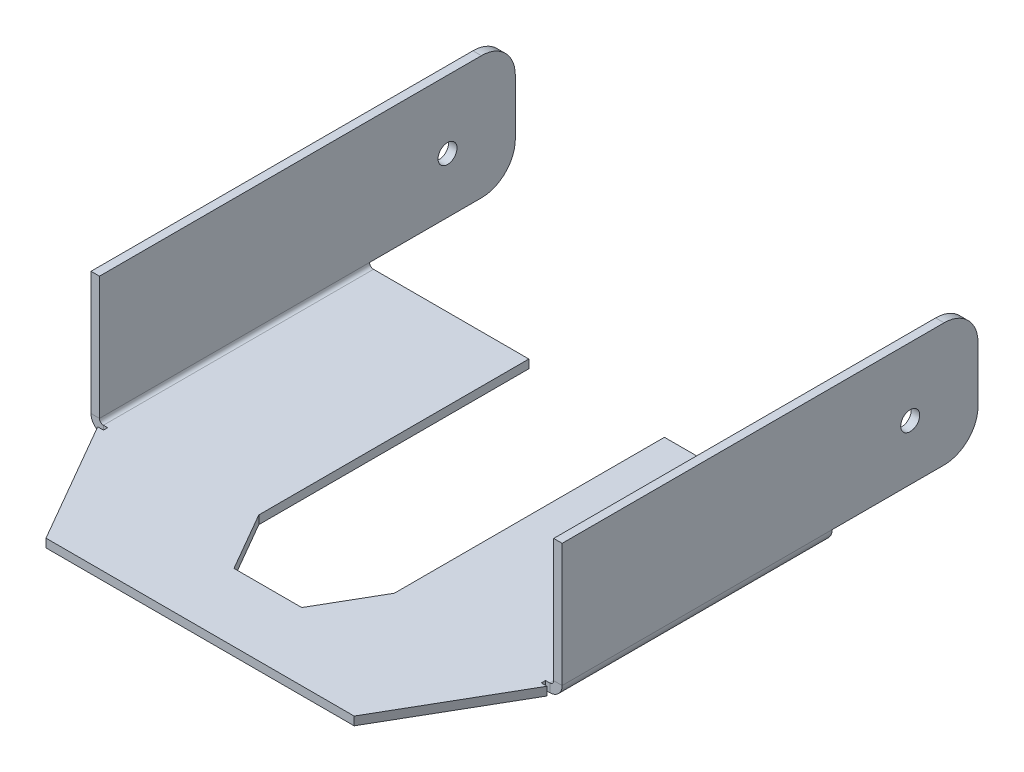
ISO-10303-21;
HEADER;
FILE_DESCRIPTION(('STEP AP214'),'2;1');
FILE_NAME('part.step','',(''),(''),'','','');
FILE_SCHEMA(('AUTOMOTIVE_DESIGN { 1 0 10303 214 1 1 1 1 }'));
ENDSEC;
DATA;
#1=APPLICATION_CONTEXT('core data for automotive mechanical design processes');
#2=APPLICATION_PROTOCOL_DEFINITION('international standard','automotive_design',2000,#1);
#3=PRODUCT_CONTEXT('',#1,'mechanical');
#4=PRODUCT('Part','Part','',(#3));
#5=PRODUCT_RELATED_PRODUCT_CATEGORY('part','',(#4));
#6=PRODUCT_DEFINITION_FORMATION('','',#4);
#7=PRODUCT_DEFINITION_CONTEXT('part definition',#1,'design');
#8=PRODUCT_DEFINITION('design','',#6,#7);
#9=PRODUCT_DEFINITION_SHAPE('','',#8);
#10=(LENGTH_UNIT() NAMED_UNIT(*) SI_UNIT(.MILLI.,.METRE.));
#11=(NAMED_UNIT(*) PLANE_ANGLE_UNIT() SI_UNIT($,.RADIAN.));
#12=(NAMED_UNIT(*) SI_UNIT($,.STERADIAN.) SOLID_ANGLE_UNIT());
#13=UNCERTAINTY_MEASURE_WITH_UNIT(LENGTH_MEASURE(1.E-05),#10,'distance_accuracy_value','');
#14=(GEOMETRIC_REPRESENTATION_CONTEXT(3) GLOBAL_UNCERTAINTY_ASSIGNED_CONTEXT((#13)) GLOBAL_UNIT_ASSIGNED_CONTEXT((#10,
#11,#12)) REPRESENTATION_CONTEXT('',''));
#15=CARTESIAN_POINT('',(0.,0.,0.));
#16=DIRECTION('',(0.,0.,1.));
#17=DIRECTION('',(1.,0.,0.));
#18=AXIS2_PLACEMENT_3D('',#15,#16,#17);
#19=CARTESIAN_POINT('',(0.,-1.5875,0.));
#20=DIRECTION('',(0.,1.,0.));
#21=DIRECTION('',(0.,0.,1.));
#22=AXIS2_PLACEMENT_3D('',#19,#20,#21);
#23=PLANE('',#22);
#24=DIRECTION('',(1.,0.,0.));
#25=VECTOR('',#24,1.);
#26=CARTESIAN_POINT('',(-12.7,-1.58750000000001,13.5262837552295));
#27=LINE('',#26,#25);
#28=CARTESIAN_POINT('',(-41.8084,-1.5875,13.5262837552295));
#29=VERTEX_POINT('',#28);
#30=CARTESIAN_POINT('',(-12.7,-1.58750000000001,13.5262837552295));
#31=VERTEX_POINT('',#30);
#32=EDGE_CURVE('E582',#29,#31,#27,.T.);
#33=ORIENTED_EDGE('',*,*,#32,.T.);
#34=DIRECTION('',(0.,0.,-1.));
#35=VECTOR('',#34,1.);
#36=CARTESIAN_POINT('',(-12.7,-1.5875,-13.7787162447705));
#37=LINE('',#36,#35);
#38=CARTESIAN_POINT('',(-12.7,-1.5875,64.1227611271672));
#39=VERTEX_POINT('',#38);
#40=EDGE_CURVE('E291',#39,#31,#37,.T.);
#41=ORIENTED_EDGE('',*,*,#40,.F.);
#42=DIRECTION('',(-0.500000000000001,0.,-0.866025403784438));
#43=VECTOR('',#42,1.);
#44=CARTESIAN_POINT('',(-12.7,-1.5875,64.1227611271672));
#45=LINE('',#44,#43);
#46=CARTESIAN_POINT('',(-6.35,-1.5875,75.1212837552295));
#47=VERTEX_POINT('',#46);
#48=EDGE_CURVE('E288',#47,#39,#45,.T.);
#49=ORIENTED_EDGE('',*,*,#48,.F.);
#50=DIRECTION('',(-1.,0.,0.));
#51=VECTOR('',#50,1.);
#52=CARTESIAN_POINT('',(-6.35,-1.5875,75.1212837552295));
#53=LINE('',#52,#51);
#54=CARTESIAN_POINT('',(6.35,-1.5875,75.1212837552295));
#55=VERTEX_POINT('',#54);
#56=EDGE_CURVE('E277',#55,#47,#53,.T.);
#57=ORIENTED_EDGE('',*,*,#56,.F.);
#58=DIRECTION('',(-0.500000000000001,0.,0.866025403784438));
#59=VECTOR('',#58,1.);
#60=CARTESIAN_POINT('',(6.35,-1.5875,75.1212837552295));
#61=LINE('',#60,#59);
#62=CARTESIAN_POINT('',(12.7,-1.5875,64.1227611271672));
#63=VERTEX_POINT('',#62);
#64=EDGE_CURVE('E274',#63,#55,#61,.T.);
#65=ORIENTED_EDGE('',*,*,#64,.F.);
#66=DIRECTION('',(0.,0.,1.));
#67=VECTOR('',#66,1.);
#68=CARTESIAN_POINT('',(12.7,-1.5875,64.1227611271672));
#69=LINE('',#68,#67);
#70=CARTESIAN_POINT('',(12.7,-1.5875,13.5262837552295));
#71=VERTEX_POINT('',#70);
#72=EDGE_CURVE('E266',#71,#63,#69,.T.);
#73=ORIENTED_EDGE('',*,*,#72,.F.);
#74=DIRECTION('',(1.,0.,0.));
#75=VECTOR('',#74,1.);
#76=CARTESIAN_POINT('',(0.,-1.5875,13.5262837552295));
#77=LINE('',#76,#75);
#78=CARTESIAN_POINT('',(41.8084,-1.5875,13.5262837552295));
#79=VERTEX_POINT('',#78);
#80=EDGE_CURVE('E250',#71,#79,#77,.T.);
#81=ORIENTED_EDGE('',*,*,#80,.T.);
#82=DIRECTION('',(0.,0.,-1.));
#83=VECTOR('',#82,1.);
#84=CARTESIAN_POINT('',(41.8084,-1.58750000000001,-13.7787162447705));
#85=LINE('',#84,#83);
#86=CARTESIAN_POINT('',(41.8084,-1.5875,64.1227611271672));
#87=VERTEX_POINT('',#86);
#88=EDGE_CURVE('E528',#79,#87,#85,.F.);
#89=ORIENTED_EDGE('',*,*,#88,.T.);
#90=DIRECTION('',(1.,0.,0.));
#91=VECTOR('',#90,1.);
#92=CARTESIAN_POINT('',(0.,-1.5875,64.1227611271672));
#93=LINE('',#92,#91);
#94=CARTESIAN_POINT('',(41.01465,-1.5875,64.1227611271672));
#95=VERTEX_POINT('',#94);
#96=EDGE_CURVE('E432',#95,#87,#93,.T.);
#97=ORIENTED_EDGE('',*,*,#96,.F.);
#98=DIRECTION('',(0.,0.,-1.));
#99=VECTOR('',#98,1.);
#100=CARTESIAN_POINT('',(41.01465,-1.5875,0.));
#101=LINE('',#100,#99);
#102=CARTESIAN_POINT('',(41.01465,-1.5875,64.9165111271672));
#103=VERTEX_POINT('',#102);
#104=EDGE_CURVE('E430',#103,#95,#101,.T.);
#105=ORIENTED_EDGE('',*,*,#104,.F.);
#106=DIRECTION('',(-1.,0.,0.));
#107=VECTOR('',#106,1.);
#108=CARTESIAN_POINT('',(0.,-1.5875,64.9165111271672));
#109=LINE('',#108,#107);
#110=CARTESIAN_POINT('',(42.0867282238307,-1.5875,64.9165111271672));
#111=VERTEX_POINT('',#110);
#112=EDGE_CURVE('E416',#111,#103,#109,.T.);
#113=ORIENTED_EDGE('',*,*,#112,.F.);
#114=DIRECTION('',(0.500000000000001,0.,-0.866025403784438));
#115=VECTOR('',#114,1.);
#116=CARTESIAN_POINT('',(42.545,-1.5875,64.1227611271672));
#117=LINE('',#116,#115);
#118=CARTESIAN_POINT('',(28.8626515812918,-1.5875,87.8212837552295));
#119=VERTEX_POINT('',#118);
#120=EDGE_CURVE('E299',#119,#111,#117,.T.);
#121=ORIENTED_EDGE('',*,*,#120,.F.);
#122=DIRECTION('',(1.,0.,0.));
#123=VECTOR('',#122,1.);
#124=CARTESIAN_POINT('',(-28.8626515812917,-1.5875,87.8212837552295));
#125=LINE('',#124,#123);
#126=CARTESIAN_POINT('',(-28.8626515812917,-1.5875,87.8212837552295));
#127=VERTEX_POINT('',#126);
#128=EDGE_CURVE('E296',#127,#119,#125,.T.);
#129=ORIENTED_EDGE('',*,*,#128,.F.);
#130=DIRECTION('',(0.500000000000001,0.,0.866025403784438));
#131=VECTOR('',#130,1.);
#132=CARTESIAN_POINT('',(-42.545,-1.5875,64.1227611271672));
#133=LINE('',#132,#131);
#134=CARTESIAN_POINT('',(-42.0867282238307,-1.5875,64.9165111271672));
#135=VERTEX_POINT('',#134);
#136=EDGE_CURVE('E294',#135,#127,#133,.T.);
#137=ORIENTED_EDGE('',*,*,#136,.F.);
#138=DIRECTION('',(-1.,0.,0.));
#139=VECTOR('',#138,1.);
#140=CARTESIAN_POINT('',(0.,-1.5875,64.9165111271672));
#141=LINE('',#140,#139);
#142=CARTESIAN_POINT('',(-41.01465,-1.5875,64.9165111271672));
#143=VERTEX_POINT('',#142);
#144=EDGE_CURVE('E283',#143,#135,#141,.T.);
#145=ORIENTED_EDGE('',*,*,#144,.F.);
#146=DIRECTION('',(0.,0.,1.));
#147=VECTOR('',#146,1.);
#148=CARTESIAN_POINT('',(-41.01465,-1.5875,0.));
#149=LINE('',#148,#147);
#150=CARTESIAN_POINT('',(-41.01465,-1.5875,64.1227611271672));
#151=VERTEX_POINT('',#150);
#152=EDGE_CURVE('E453',#151,#143,#149,.T.);
#153=ORIENTED_EDGE('',*,*,#152,.F.);
#154=DIRECTION('',(1.,0.,0.));
#155=VECTOR('',#154,1.);
#156=CARTESIAN_POINT('',(0.,-1.5875,64.1227611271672));
#157=LINE('',#156,#155);
#158=CARTESIAN_POINT('',(-41.8084,-1.5875,64.1227611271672));
#159=VERTEX_POINT('',#158);
#160=EDGE_CURVE('E439',#159,#151,#157,.T.);
#161=ORIENTED_EDGE('',*,*,#160,.F.);
#162=DIRECTION('',(0.,0.,1.));
#163=VECTOR('',#162,1.);
#164=CARTESIAN_POINT('',(-41.8084,-1.5875,64.1227611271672));
#165=LINE('',#164,#163);
#166=EDGE_CURVE('E398',#159,#29,#165,.F.);
#167=ORIENTED_EDGE('',*,*,#166,.T.);
#168=EDGE_LOOP('',(#33,#41,#49,#57,#65,#73,#81,#89,#97,#105,#113,#121,#129,#137,#145,#153,#161,#167));
#169=FACE_BOUND('',#168,.T.);
#170=ADVANCED_FACE('F40',(#169),#23,.F.);
#171=CARTESIAN_POINT('',(0.,0.,0.));
#172=DIRECTION('',(0.,1.,0.));
#173=DIRECTION('',(0.,0.,1.));
#174=AXIS2_PLACEMENT_3D('',#171,#172,#173);
#175=PLANE('',#174);
#176=DIRECTION('',(0.,0.,-1.));
#177=VECTOR('',#176,1.);
#178=CARTESIAN_POINT('',(-12.7,0.,-13.7787162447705));
#179=LINE('',#178,#177);
#180=CARTESIAN_POINT('',(-12.7,0.,64.1227611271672));
#181=VERTEX_POINT('',#180);
#182=CARTESIAN_POINT('',(-12.7,0.,13.5262837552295));
#183=VERTEX_POINT('',#182);
#184=EDGE_CURVE('E313',#181,#183,#179,.T.);
#185=ORIENTED_EDGE('',*,*,#184,.T.);
#186=DIRECTION('',(1.,0.,0.));
#187=VECTOR('',#186,1.);
#188=CARTESIAN_POINT('',(0.,0.,13.5262837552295));
#189=LINE('',#188,#187);
#190=CARTESIAN_POINT('',(-41.8084,0.,13.5262837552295));
#191=VERTEX_POINT('',#190);
#192=EDGE_CURVE('E578',#191,#183,#189,.T.);
#193=ORIENTED_EDGE('',*,*,#192,.F.);
#194=DIRECTION('',(0.,0.,1.));
#195=VECTOR('',#194,1.);
#196=CARTESIAN_POINT('',(-41.8084,0.,64.1227611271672));
#197=LINE('',#196,#195);
#198=CARTESIAN_POINT('',(-41.8084,0.,64.1227611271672));
#199=VERTEX_POINT('',#198);
#200=EDGE_CURVE('E405',#199,#191,#197,.F.);
#201=ORIENTED_EDGE('',*,*,#200,.F.);
#202=DIRECTION('',(-1.,0.,0.));
#203=VECTOR('',#202,1.);
#204=CARTESIAN_POINT('',(-41.01465,0.,64.1227611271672));
#205=LINE('',#204,#203);
#206=CARTESIAN_POINT('',(-41.01465,0.,64.1227611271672));
#207=VERTEX_POINT('',#206);
#208=EDGE_CURVE('E445',#207,#199,#205,.T.);
#209=ORIENTED_EDGE('',*,*,#208,.F.);
#210=DIRECTION('',(0.,0.,-1.));
#211=VECTOR('',#210,1.);
#212=CARTESIAN_POINT('',(-41.01465,0.,64.9165111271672));
#213=LINE('',#212,#211);
#214=CARTESIAN_POINT('',(-41.01465,0.,64.9165111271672));
#215=VERTEX_POINT('',#214);
#216=EDGE_CURVE('E441',#215,#207,#213,.T.);
#217=ORIENTED_EDGE('',*,*,#216,.F.);
#218=DIRECTION('',(1.,0.,0.));
#219=VECTOR('',#218,1.);
#220=CARTESIAN_POINT('',(-42.0867282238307,0.,64.9165111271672));
#221=LINE('',#220,#219);
#222=CARTESIAN_POINT('',(-42.0867282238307,0.,64.9165111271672));
#223=VERTEX_POINT('',#222);
#224=EDGE_CURVE('E436',#223,#215,#221,.T.);
#225=ORIENTED_EDGE('',*,*,#224,.F.);
#226=DIRECTION('',(0.500000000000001,0.,0.866025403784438));
#227=VECTOR('',#226,1.);
#228=CARTESIAN_POINT('',(-42.545,0.,64.1227611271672));
#229=LINE('',#228,#227);
#230=CARTESIAN_POINT('',(-28.8626515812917,0.,87.8212837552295));
#231=VERTEX_POINT('',#230);
#232=EDGE_CURVE('E316',#223,#231,#229,.T.);
#233=ORIENTED_EDGE('',*,*,#232,.T.);
#234=DIRECTION('',(1.,0.,0.));
#235=VECTOR('',#234,1.);
#236=CARTESIAN_POINT('',(-28.8626515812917,0.,87.8212837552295));
#237=LINE('',#236,#235);
#238=CARTESIAN_POINT('',(28.8626515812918,0.,87.8212837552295));
#239=VERTEX_POINT('',#238);
#240=EDGE_CURVE('E280',#231,#239,#237,.T.);
#241=ORIENTED_EDGE('',*,*,#240,.T.);
#242=DIRECTION('',(0.500000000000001,0.,-0.866025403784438));
#243=VECTOR('',#242,1.);
#244=CARTESIAN_POINT('',(42.545,0.,64.1227611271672));
#245=LINE('',#244,#243);
#246=CARTESIAN_POINT('',(42.0867282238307,0.,64.9165111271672));
#247=VERTEX_POINT('',#246);
#248=EDGE_CURVE('E275',#239,#247,#245,.T.);
#249=ORIENTED_EDGE('',*,*,#248,.T.);
#250=DIRECTION('',(1.,0.,0.));
#251=VECTOR('',#250,1.);
#252=CARTESIAN_POINT('',(41.01465,0.,64.9165111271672));
#253=LINE('',#252,#251);
#254=CARTESIAN_POINT('',(41.01465,0.,64.9165111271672));
#255=VERTEX_POINT('',#254);
#256=EDGE_CURVE('E421',#255,#247,#253,.T.);
#257=ORIENTED_EDGE('',*,*,#256,.F.);
#258=DIRECTION('',(0.,0.,1.));
#259=VECTOR('',#258,1.);
#260=CARTESIAN_POINT('',(41.01465,0.,64.1227611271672));
#261=LINE('',#260,#259);
#262=CARTESIAN_POINT('',(41.01465,0.,64.1227611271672));
#263=VERTEX_POINT('',#262);
#264=EDGE_CURVE('E417',#263,#255,#261,.T.);
#265=ORIENTED_EDGE('',*,*,#264,.F.);
#266=DIRECTION('',(-1.,0.,0.));
#267=VECTOR('',#266,1.);
#268=CARTESIAN_POINT('',(41.8084,0.,64.1227611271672));
#269=LINE('',#268,#267);
#270=CARTESIAN_POINT('',(41.8084,0.,64.1227611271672));
#271=VERTEX_POINT('',#270);
#272=EDGE_CURVE('E413',#271,#263,#269,.T.);
#273=ORIENTED_EDGE('',*,*,#272,.F.);
#274=DIRECTION('',(0.,0.,-1.));
#275=VECTOR('',#274,1.);
#276=CARTESIAN_POINT('',(41.8084,0.,-13.7787162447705));
#277=LINE('',#276,#275);
#278=CARTESIAN_POINT('',(41.8084,0.,13.5262837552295));
#279=VERTEX_POINT('',#278);
#280=EDGE_CURVE('E522',#279,#271,#277,.F.);
#281=ORIENTED_EDGE('',*,*,#280,.F.);
#282=DIRECTION('',(1.,0.,0.));
#283=VECTOR('',#282,1.);
#284=CARTESIAN_POINT('',(27.2542,0.,13.5262837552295));
#285=LINE('',#284,#283);
#286=CARTESIAN_POINT('',(12.7,0.,13.5262837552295));
#287=VERTEX_POINT('',#286);
#288=EDGE_CURVE('E260',#287,#279,#285,.T.);
#289=ORIENTED_EDGE('',*,*,#288,.F.);
#290=DIRECTION('',(0.,0.,1.));
#291=VECTOR('',#290,1.);
#292=CARTESIAN_POINT('',(12.7,0.,64.1227611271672));
#293=LINE('',#292,#291);
#294=CARTESIAN_POINT('',(12.7,0.,64.1227611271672));
#295=VERTEX_POINT('',#294);
#296=EDGE_CURVE('E268',#287,#295,#293,.T.);
#297=ORIENTED_EDGE('',*,*,#296,.T.);
#298=DIRECTION('',(-0.500000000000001,0.,0.866025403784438));
#299=VECTOR('',#298,1.);
#300=CARTESIAN_POINT('',(6.35,0.,75.1212837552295));
#301=LINE('',#300,#299);
#302=CARTESIAN_POINT('',(6.35,0.,75.1212837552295));
#303=VERTEX_POINT('',#302);
#304=EDGE_CURVE('E304',#295,#303,#301,.T.);
#305=ORIENTED_EDGE('',*,*,#304,.T.);
#306=DIRECTION('',(-1.,0.,0.));
#307=VECTOR('',#306,1.);
#308=CARTESIAN_POINT('',(-6.35,0.,75.1212837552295));
#309=LINE('',#308,#307);
#310=CARTESIAN_POINT('',(-6.35,0.,75.1212837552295));
#311=VERTEX_POINT('',#310);
#312=EDGE_CURVE('E307',#303,#311,#309,.T.);
#313=ORIENTED_EDGE('',*,*,#312,.T.);
#314=DIRECTION('',(-0.500000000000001,0.,-0.866025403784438));
#315=VECTOR('',#314,1.);
#316=CARTESIAN_POINT('',(-12.7,0.,64.1227611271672));
#317=LINE('',#316,#315);
#318=EDGE_CURVE('E310',#311,#181,#317,.T.);
#319=ORIENTED_EDGE('',*,*,#318,.T.);
#320=EDGE_LOOP('',(#185,#193,#201,#209,#217,#225,#233,#241,#249,#257,#265,#273,#281,#289,#297,
#305,#313,#319));
#321=FACE_BOUND('',#320,.T.);
#322=ADVANCED_FACE('F473',(#321),#175,.T.);
#323=CARTESIAN_POINT('',(-12.7,-1.5875,-13.7787162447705));
#324=DIRECTION('',(1.,0.,0.));
#325=DIRECTION('',(0.,0.,-1.));
#326=AXIS2_PLACEMENT_3D('',#323,#324,#325);
#327=PLANE('',#326);
#328=ORIENTED_EDGE('',*,*,#40,.T.);
#329=DIRECTION('',(0.,-1.,0.));
#330=VECTOR('',#329,1.);
#331=CARTESIAN_POINT('',(-12.7,-1.58750000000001,13.5262837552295));
#332=LINE('',#331,#330);
#333=EDGE_CURVE('E584',#31,#183,#332,.F.);
#334=ORIENTED_EDGE('',*,*,#333,.T.);
#335=ORIENTED_EDGE('',*,*,#184,.F.);
#336=DIRECTION('',(0.,1.,0.));
#337=VECTOR('',#336,1.);
#338=CARTESIAN_POINT('',(-12.7,-1.5875,64.1227611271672));
#339=LINE('',#338,#337);
#340=EDGE_CURVE('E326',#39,#181,#339,.T.);
#341=ORIENTED_EDGE('',*,*,#340,.F.);
#342=EDGE_LOOP('',(#328,#334,#335,#341));
#343=FACE_BOUND('',#342,.T.);
#344=ADVANCED_FACE('F620',(#343),#327,.T.);
#345=CARTESIAN_POINT('',(12.7,-1.5875,64.1227611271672));
#346=DIRECTION('',(-1.,0.,0.));
#347=DIRECTION('',(0.,0.,1.));
#348=AXIS2_PLACEMENT_3D('',#345,#346,#347);
#349=PLANE('',#348);
#350=ORIENTED_EDGE('',*,*,#296,.F.);
#351=DIRECTION('',(0.,1.,0.));
#352=VECTOR('',#351,1.);
#353=CARTESIAN_POINT('',(12.7,-1.5875,13.5262837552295));
#354=LINE('',#353,#352);
#355=EDGE_CURVE('E253',#287,#71,#354,.F.);
#356=ORIENTED_EDGE('',*,*,#355,.T.);
#357=ORIENTED_EDGE('',*,*,#72,.T.);
#358=DIRECTION('',(0.,1.,0.));
#359=VECTOR('',#358,1.);
#360=CARTESIAN_POINT('',(12.7,-1.5875,64.1227611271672));
#361=LINE('',#360,#359);
#362=EDGE_CURVE('E302',#63,#295,#361,.T.);
#363=ORIENTED_EDGE('',*,*,#362,.T.);
#364=EDGE_LOOP('',(#350,#356,#357,#363));
#365=FACE_BOUND('',#364,.T.);
#366=ADVANCED_FACE('F264',(#365),#349,.T.);
#367=CARTESIAN_POINT('',(-41.8084,0.7366,64.1227611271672));
#368=DIRECTION('',(0.,0.,1.));
#369=DIRECTION('',(-1.,0.,0.));
#370=AXIS2_PLACEMENT_3D('',#367,#368,#369);
#371=CYLINDRICAL_SURFACE('',#370,2.3241);
#372=DIRECTION('',(0.,0.,-1.));
#373=VECTOR('',#372,1.);
#374=CARTESIAN_POINT('',(-44.1325,0.736599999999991,0.));
#375=LINE('',#374,#373);
#376=CARTESIAN_POINT('',(-44.1325,0.736599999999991,64.1227611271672));
#377=VERTEX_POINT('',#376);
#378=CARTESIAN_POINT('',(-44.1325,0.73659999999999,13.5262837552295));
#379=VERTEX_POINT('',#378);
#380=EDGE_CURVE('E498',#377,#379,#375,.T.);
#381=ORIENTED_EDGE('',*,*,#380,.T.);
#382=CARTESIAN_POINT('',(-41.8084,0.736600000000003,13.5262837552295));
#383=DIRECTION('',(0.,0.,1.));
#384=DIRECTION('',(1.,0.,0.));
#385=AXIS2_PLACEMENT_3D('',#382,#383,#384);
#386=CIRCLE('',#385,2.3241);
#387=EDGE_CURVE('E491',#379,#29,#386,.T.);
#388=ORIENTED_EDGE('',*,*,#387,.T.);
#389=ORIENTED_EDGE('',*,*,#166,.F.);
#390=CARTESIAN_POINT('',(-41.8084,0.7366,64.1227611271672));
#391=DIRECTION('',(0.,0.,1.));
#392=DIRECTION('',(1.,0.,0.));
#393=AXIS2_PLACEMENT_3D('',#390,#391,#392);
#394=CIRCLE('',#393,2.3241);
#395=EDGE_CURVE('E402',#377,#159,#394,.T.);
#396=ORIENTED_EDGE('',*,*,#395,.F.);
#397=EDGE_LOOP('',(#381,#388,#389,#396));
#398=FACE_BOUND('',#397,.T.);
#399=ADVANCED_FACE('F488',(#398),#371,.T.);
#400=CARTESIAN_POINT('',(-41.8084,0.7366,64.1227611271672));
#401=DIRECTION('',(0.,0.,1.));
#402=DIRECTION('',(-1.,0.,0.));
#403=AXIS2_PLACEMENT_3D('',#400,#401,#402);
#404=CYLINDRICAL_SURFACE('',#403,0.736599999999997);
#405=CARTESIAN_POINT('',(-41.8084,0.736600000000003,13.5262837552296));
#406=DIRECTION('',(0.,0.,-1.));
#407=DIRECTION('',(-1.,0.,0.));
#408=AXIS2_PLACEMENT_3D('',#405,#406,#407);
#409=CIRCLE('',#408,0.7366);
#410=CARTESIAN_POINT('',(-42.545,0.736599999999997,13.5262837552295));
#411=VERTEX_POINT('',#410);
#412=EDGE_CURVE('E573',#411,#191,#409,.F.);
#413=ORIENTED_EDGE('',*,*,#412,.F.);
#414=DIRECTION('',(0.,0.,1.));
#415=VECTOR('',#414,1.);
#416=CARTESIAN_POINT('',(-42.545,0.736599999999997,-13.7787162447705));
#417=LINE('',#416,#415);
#418=CARTESIAN_POINT('',(-42.545,0.736599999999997,64.1227611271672));
#419=VERTEX_POINT('',#418);
#420=EDGE_CURVE('E515',#411,#419,#417,.T.);
#421=ORIENTED_EDGE('',*,*,#420,.T.);
#422=CARTESIAN_POINT('',(-41.8084,0.7366,64.1227611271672));
#423=DIRECTION('',(0.,0.,1.));
#424=DIRECTION('',(1.,0.,0.));
#425=AXIS2_PLACEMENT_3D('',#422,#423,#424);
#426=CIRCLE('',#425,0.736599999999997);
#427=EDGE_CURVE('E397',#419,#199,#426,.T.);
#428=ORIENTED_EDGE('',*,*,#427,.T.);
#429=ORIENTED_EDGE('',*,*,#200,.T.);
#430=EDGE_LOOP('',(#413,#421,#428,#429));
#431=FACE_BOUND('',#430,.T.);
#432=ADVANCED_FACE('F857',(#431),#404,.F.);
#433=CARTESIAN_POINT('',(41.8084,0.736599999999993,-13.7787162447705));
#434=DIRECTION('',(0.,0.,-1.));
#435=DIRECTION('',(1.,0.,0.));
#436=AXIS2_PLACEMENT_3D('',#433,#434,#435);
#437=CYLINDRICAL_SURFACE('',#436,2.3241);
#438=ORIENTED_EDGE('',*,*,#88,.F.);
#439=CARTESIAN_POINT('',(41.8084,0.736599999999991,13.5262837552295));
#440=DIRECTION('',(0.,0.,1.));
#441=DIRECTION('',(1.,0.,0.));
#442=AXIS2_PLACEMENT_3D('',#439,#440,#441);
#443=CIRCLE('',#442,2.3241);
#444=CARTESIAN_POINT('',(44.1325,0.736600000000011,13.5262837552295));
#445=VERTEX_POINT('',#444);
#446=EDGE_CURVE('E561',#79,#445,#443,.T.);
#447=ORIENTED_EDGE('',*,*,#446,.T.);
#448=DIRECTION('',(0.,0.,1.));
#449=VECTOR('',#448,1.);
#450=CARTESIAN_POINT('',(44.1325,0.736599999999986,0.));
#451=LINE('',#450,#449);
#452=CARTESIAN_POINT('',(44.1325,0.736599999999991,64.1227611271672));
#453=VERTEX_POINT('',#452);
#454=EDGE_CURVE('E552',#445,#453,#451,.T.);
#455=ORIENTED_EDGE('',*,*,#454,.T.);
#456=CARTESIAN_POINT('',(41.8084,0.736599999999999,64.1227611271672));
#457=DIRECTION('',(0.,0.,-1.));
#458=DIRECTION('',(0.,1.,0.));
#459=AXIS2_PLACEMENT_3D('',#456,#457,#458);
#460=CIRCLE('',#459,2.3241);
#461=EDGE_CURVE('E521',#87,#453,#460,.F.);
#462=ORIENTED_EDGE('',*,*,#461,.F.);
#463=EDGE_LOOP('',(#438,#447,#455,#462));
#464=FACE_BOUND('',#463,.T.);
#465=ADVANCED_FACE('F848',(#464),#437,.T.);
#466=CARTESIAN_POINT('',(41.8084,0.736599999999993,-13.7787162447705));
#467=DIRECTION('',(0.,0.,-1.));
#468=DIRECTION('',(1.,0.,0.));
#469=AXIS2_PLACEMENT_3D('',#466,#467,#468);
#470=CYLINDRICAL_SURFACE('',#469,0.736600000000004);
#471=CARTESIAN_POINT('',(41.8084,0.736599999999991,13.5262837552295));
#472=DIRECTION('',(0.,0.,1.));
#473=DIRECTION('',(0.,-1.,0.));
#474=AXIS2_PLACEMENT_3D('',#471,#472,#473);
#475=CIRCLE('',#474,0.7366);
#476=CARTESIAN_POINT('',(42.545,0.736599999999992,13.5262837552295));
#477=VERTEX_POINT('',#476);
#478=EDGE_CURVE('E567',#279,#477,#475,.T.);
#479=ORIENTED_EDGE('',*,*,#478,.F.);
#480=ORIENTED_EDGE('',*,*,#280,.T.);
#481=CARTESIAN_POINT('',(41.8084,0.736599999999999,64.1227611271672));
#482=DIRECTION('',(0.,0.,-1.));
#483=DIRECTION('',(0.,1.,0.));
#484=AXIS2_PLACEMENT_3D('',#481,#482,#483);
#485=CIRCLE('',#484,0.736600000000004);
#486=CARTESIAN_POINT('',(42.545,0.736599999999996,64.1227611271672));
#487=VERTEX_POINT('',#486);
#488=EDGE_CURVE('E524',#271,#487,#485,.F.);
#489=ORIENTED_EDGE('',*,*,#488,.T.);
#490=DIRECTION('',(0.,0.,-1.));
#491=VECTOR('',#490,1.);
#492=CARTESIAN_POINT('',(42.545,0.736599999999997,64.1227611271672));
#493=LINE('',#492,#491);
#494=EDGE_CURVE('E556',#487,#477,#493,.T.);
#495=ORIENTED_EDGE('',*,*,#494,.T.);
#496=EDGE_LOOP('',(#479,#480,#489,#495));
#497=FACE_BOUND('',#496,.T.);
#498=ADVANCED_FACE('F628',(#497),#470,.F.);
#499=CARTESIAN_POINT('',(42.545,-1.5875,64.1227611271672));
#500=DIRECTION('',(0.866025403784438,0.,0.500000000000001));
#501=DIRECTION('',(0.500000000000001,0.,-0.866025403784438));
#502=AXIS2_PLACEMENT_3D('',#499,#500,#501);
#503=PLANE('',#502);
#504=ORIENTED_EDGE('',*,*,#120,.T.);
#505=DIRECTION('',(0.,-1.,0.));
#506=VECTOR('',#505,1.);
#507=CARTESIAN_POINT('',(42.0867282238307,0.,64.9165111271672));
#508=LINE('',#507,#506);
#509=EDGE_CURVE('E423',#247,#111,#508,.T.);
#510=ORIENTED_EDGE('',*,*,#509,.F.);
#511=ORIENTED_EDGE('',*,*,#248,.F.);
#512=DIRECTION('',(0.,1.,0.));
#513=VECTOR('',#512,1.);
#514=CARTESIAN_POINT('',(28.8626515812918,-1.5875,87.8212837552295));
#515=LINE('',#514,#513);
#516=EDGE_CURVE('E320',#119,#239,#515,.T.);
#517=ORIENTED_EDGE('',*,*,#516,.F.);
#518=EDGE_LOOP('',(#504,#510,#511,#517));
#519=FACE_BOUND('',#518,.T.);
#520=ADVANCED_FACE('F625',(#519),#503,.T.);
#521=CARTESIAN_POINT('',(-42.545,-1.5875,64.1227611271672));
#522=DIRECTION('',(-0.866025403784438,0.,0.500000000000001));
#523=DIRECTION('',(0.500000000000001,0.,0.866025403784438));
#524=AXIS2_PLACEMENT_3D('',#521,#522,#523);
#525=PLANE('',#524);
#526=ORIENTED_EDGE('',*,*,#232,.F.);
#527=DIRECTION('',(0.,-1.,0.));
#528=VECTOR('',#527,1.);
#529=CARTESIAN_POINT('',(-42.0867282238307,0.,64.9165111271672));
#530=LINE('',#529,#528);
#531=EDGE_CURVE('E440',#223,#135,#530,.T.);
#532=ORIENTED_EDGE('',*,*,#531,.T.);
#533=ORIENTED_EDGE('',*,*,#136,.T.);
#534=DIRECTION('',(0.,1.,0.));
#535=VECTOR('',#534,1.);
#536=CARTESIAN_POINT('',(-28.8626515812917,-1.5875,87.8212837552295));
#537=LINE('',#536,#535);
#538=EDGE_CURVE('E323',#127,#231,#537,.T.);
#539=ORIENTED_EDGE('',*,*,#538,.T.);
#540=EDGE_LOOP('',(#526,#532,#533,#539));
#541=FACE_BOUND('',#540,.T.);
#542=ADVANCED_FACE('F463',(#541),#525,.T.);
#543=CARTESIAN_POINT('',(-28.8626515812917,-1.5875,87.8212837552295));
#544=DIRECTION('',(0.,0.,1.));
#545=DIRECTION('',(1.,0.,0.));
#546=AXIS2_PLACEMENT_3D('',#543,#544,#545);
#547=PLANE('',#546);
#548=ORIENTED_EDGE('',*,*,#240,.F.);
#549=ORIENTED_EDGE('',*,*,#538,.F.);
#550=ORIENTED_EDGE('',*,*,#128,.T.);
#551=ORIENTED_EDGE('',*,*,#516,.T.);
#552=EDGE_LOOP('',(#548,#549,#550,#551));
#553=FACE_BOUND('',#552,.T.);
#554=ADVANCED_FACE('F470',(#553),#547,.T.);
#555=CARTESIAN_POINT('',(-12.7,-1.5875,64.1227611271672));
#556=DIRECTION('',(0.866025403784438,0.,-0.500000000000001));
#557=DIRECTION('',(-0.500000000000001,0.,-0.866025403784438));
#558=AXIS2_PLACEMENT_3D('',#555,#556,#557);
#559=PLANE('',#558);
#560=ORIENTED_EDGE('',*,*,#318,.F.);
#561=DIRECTION('',(0.,1.,0.));
#562=VECTOR('',#561,1.);
#563=CARTESIAN_POINT('',(-6.35,-1.5875,75.1212837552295));
#564=LINE('',#563,#562);
#565=EDGE_CURVE('E328',#47,#311,#564,.T.);
#566=ORIENTED_EDGE('',*,*,#565,.F.);
#567=ORIENTED_EDGE('',*,*,#48,.T.);
#568=ORIENTED_EDGE('',*,*,#340,.T.);
#569=EDGE_LOOP('',(#560,#566,#567,#568));
#570=FACE_BOUND('',#569,.T.);
#571=ADVANCED_FACE('F632',(#570),#559,.T.);
#572=CARTESIAN_POINT('',(-6.35,-1.5875,75.1212837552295));
#573=DIRECTION('',(0.,0.,-1.));
#574=DIRECTION('',(-1.,0.,0.));
#575=AXIS2_PLACEMENT_3D('',#572,#573,#574);
#576=PLANE('',#575);
#577=ORIENTED_EDGE('',*,*,#312,.F.);
#578=DIRECTION('',(0.,1.,0.));
#579=VECTOR('',#578,1.);
#580=CARTESIAN_POINT('',(6.35,-1.5875,75.1212837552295));
#581=LINE('',#580,#579);
#582=EDGE_CURVE('E330',#55,#303,#581,.T.);
#583=ORIENTED_EDGE('',*,*,#582,.F.);
#584=ORIENTED_EDGE('',*,*,#56,.T.);
#585=ORIENTED_EDGE('',*,*,#565,.T.);
#586=EDGE_LOOP('',(#577,#583,#584,#585));
#587=FACE_BOUND('',#586,.T.);
#588=ADVANCED_FACE('F640',(#587),#576,.T.);
#589=CARTESIAN_POINT('',(6.35,-1.5875,75.1212837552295));
#590=DIRECTION('',(-0.866025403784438,0.,-0.500000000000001));
#591=DIRECTION('',(-0.500000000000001,0.,0.866025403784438));
#592=AXIS2_PLACEMENT_3D('',#589,#590,#591);
#593=PLANE('',#592);
#594=ORIENTED_EDGE('',*,*,#304,.F.);
#595=ORIENTED_EDGE('',*,*,#362,.F.);
#596=ORIENTED_EDGE('',*,*,#64,.T.);
#597=ORIENTED_EDGE('',*,*,#582,.T.);
#598=EDGE_LOOP('',(#594,#595,#596,#597));
#599=FACE_BOUND('',#598,.T.);
#600=ADVANCED_FACE('F644',(#599),#593,.T.);
#601=CARTESIAN_POINT('',(-42.0867282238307,0.,64.9165111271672));
#602=DIRECTION('',(0.,0.,-1.));
#603=DIRECTION('',(0.,1.,0.));
#604=AXIS2_PLACEMENT_3D('',#601,#602,#603);
#605=PLANE('',#604);
#606=DIRECTION('',(0.,-1.,0.));
#607=VECTOR('',#606,1.);
#608=CARTESIAN_POINT('',(-41.01465,0.,64.9165111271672));
#609=LINE('',#608,#607);
#610=EDGE_CURVE('E444',#215,#143,#609,.T.);
#611=ORIENTED_EDGE('',*,*,#610,.T.);
#612=ORIENTED_EDGE('',*,*,#144,.T.);
#613=ORIENTED_EDGE('',*,*,#531,.F.);
#614=ORIENTED_EDGE('',*,*,#224,.T.);
#615=EDGE_LOOP('',(#611,#612,#613,#614));
#616=FACE_BOUND('',#615,.T.);
#617=ADVANCED_FACE('F458',(#616),#605,.T.);
#618=CARTESIAN_POINT('',(-41.01465,0.,64.9165111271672));
#619=DIRECTION('',(-1.,0.,0.));
#620=DIRECTION('',(0.,0.,1.));
#621=AXIS2_PLACEMENT_3D('',#618,#619,#620);
#622=PLANE('',#621);
#623=DIRECTION('',(0.,-1.,0.));
#624=VECTOR('',#623,1.);
#625=CARTESIAN_POINT('',(-41.01465,0.,64.1227611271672));
#626=LINE('',#625,#624);
#627=EDGE_CURVE('E435',#207,#151,#626,.T.);
#628=ORIENTED_EDGE('',*,*,#627,.T.);
#629=ORIENTED_EDGE('',*,*,#152,.T.);
#630=ORIENTED_EDGE('',*,*,#610,.F.);
#631=ORIENTED_EDGE('',*,*,#216,.T.);
#632=EDGE_LOOP('',(#628,#629,#630,#631));
#633=FACE_BOUND('',#632,.T.);
#634=ADVANCED_FACE('F478',(#633),#622,.T.);
#635=CARTESIAN_POINT('',(-41.01465,0.,64.1227611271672));
#636=DIRECTION('',(0.,0.,1.));
#637=DIRECTION('',(0.,-1.,0.));
#638=AXIS2_PLACEMENT_3D('',#635,#636,#637);
#639=PLANE('',#638);
#640=DIRECTION('',(0.,-1.,0.));
#641=VECTOR('',#640,1.);
#642=CARTESIAN_POINT('',(-41.8084,0.,64.1227611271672));
#643=LINE('',#642,#641);
#644=EDGE_CURVE('E401',#199,#159,#643,.T.);
#645=ORIENTED_EDGE('',*,*,#644,.T.);
#646=ORIENTED_EDGE('',*,*,#160,.T.);
#647=ORIENTED_EDGE('',*,*,#627,.F.);
#648=ORIENTED_EDGE('',*,*,#208,.T.);
#649=EDGE_LOOP('',(#645,#646,#647,#648));
#650=FACE_BOUND('',#649,.T.);
#651=ADVANCED_FACE('F482',(#650),#639,.T.);
#652=CARTESIAN_POINT('',(41.8084,0.,64.1227611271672));
#653=DIRECTION('',(0.,0.,1.));
#654=DIRECTION('',(0.,-1.,0.));
#655=AXIS2_PLACEMENT_3D('',#652,#653,#654);
#656=PLANE('',#655);
#657=DIRECTION('',(0.,-1.,0.));
#658=VECTOR('',#657,1.);
#659=CARTESIAN_POINT('',(41.01465,0.,64.1227611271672));
#660=LINE('',#659,#658);
#661=EDGE_CURVE('E420',#263,#95,#660,.T.);
#662=ORIENTED_EDGE('',*,*,#661,.T.);
#663=ORIENTED_EDGE('',*,*,#96,.T.);
#664=DIRECTION('',(0.,-1.,0.));
#665=VECTOR('',#664,1.);
#666=CARTESIAN_POINT('',(41.8084,0.,64.1227611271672));
#667=LINE('',#666,#665);
#668=EDGE_CURVE('E517',#271,#87,#667,.T.);
#669=ORIENTED_EDGE('',*,*,#668,.F.);
#670=ORIENTED_EDGE('',*,*,#272,.T.);
#671=EDGE_LOOP('',(#662,#663,#669,#670));
#672=FACE_BOUND('',#671,.T.);
#673=ADVANCED_FACE('F949',(#672),#656,.T.);
#674=CARTESIAN_POINT('',(41.01465,0.,64.1227611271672));
#675=DIRECTION('',(1.,0.,0.));
#676=DIRECTION('',(0.,0.,-1.));
#677=AXIS2_PLACEMENT_3D('',#674,#675,#676);
#678=PLANE('',#677);
#679=DIRECTION('',(0.,-1.,0.));
#680=VECTOR('',#679,1.);
#681=CARTESIAN_POINT('',(41.01465,0.,64.9165111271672));
#682=LINE('',#681,#680);
#683=EDGE_CURVE('E412',#255,#103,#682,.T.);
#684=ORIENTED_EDGE('',*,*,#683,.T.);
#685=ORIENTED_EDGE('',*,*,#104,.T.);
#686=ORIENTED_EDGE('',*,*,#661,.F.);
#687=ORIENTED_EDGE('',*,*,#264,.T.);
#688=EDGE_LOOP('',(#684,#685,#686,#687));
#689=FACE_BOUND('',#688,.T.);
#690=ADVANCED_FACE('F938',(#689),#678,.T.);
#691=CARTESIAN_POINT('',(41.01465,0.,64.9165111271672));
#692=DIRECTION('',(0.,0.,-1.));
#693=DIRECTION('',(0.,1.,0.));
#694=AXIS2_PLACEMENT_3D('',#691,#692,#693);
#695=PLANE('',#694);
#696=ORIENTED_EDGE('',*,*,#509,.T.);
#697=ORIENTED_EDGE('',*,*,#112,.T.);
#698=ORIENTED_EDGE('',*,*,#683,.F.);
#699=ORIENTED_EDGE('',*,*,#256,.T.);
#700=EDGE_LOOP('',(#696,#697,#698,#699));
#701=FACE_BOUND('',#700,.T.);
#702=ADVANCED_FACE('F928',(#701),#695,.T.);
#703=CARTESIAN_POINT('',(-41.8084,0.7366,64.1227611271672));
#704=DIRECTION('',(0.,0.,-1.));
#705=DIRECTION('',(-1.,0.,0.));
#706=AXIS2_PLACEMENT_3D('',#703,#704,#705);
#707=PLANE('',#706);
#708=ORIENTED_EDGE('',*,*,#427,.F.);
#709=DIRECTION('',(-1.,0.,0.));
#710=VECTOR('',#709,1.);
#711=CARTESIAN_POINT('',(-42.545,0.736599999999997,64.1227611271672));
#712=LINE('',#711,#710);
#713=EDGE_CURVE('E494',#419,#377,#712,.T.);
#714=ORIENTED_EDGE('',*,*,#713,.T.);
#715=ORIENTED_EDGE('',*,*,#395,.T.);
#716=ORIENTED_EDGE('',*,*,#644,.F.);
#717=EDGE_LOOP('',(#708,#714,#715,#716));
#718=FACE_BOUND('',#717,.T.);
#719=ADVANCED_FACE('F492',(#718),#707,.F.);
#720=CARTESIAN_POINT('',(-44.1325,0.,-13.7787162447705));
#721=DIRECTION('',(0.,0.,1.));
#722=DIRECTION('',(1.,0.,0.));
#723=AXIS2_PLACEMENT_3D('',#720,#721,#722);
#724=PLANE('',#723);
#725=DIRECTION('',(0.,-1.,0.));
#726=VECTOR('',#725,1.);
#727=CARTESIAN_POINT('',(-44.1325,0.,-13.7787162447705));
#728=LINE('',#727,#726);
#729=CARTESIAN_POINT('',(-44.1325000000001,17.4625,-13.7787162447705));
#730=VERTEX_POINT('',#729);
#731=CARTESIAN_POINT('',(-44.1325,7.08660000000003,-13.7787162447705));
#732=VERTEX_POINT('',#731);
#733=EDGE_CURVE('E369',#730,#732,#728,.T.);
#734=ORIENTED_EDGE('',*,*,#733,.F.);
#735=DIRECTION('',(1.,0.,0.));
#736=VECTOR('',#735,1.);
#737=CARTESIAN_POINT('',(-44.1325000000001,17.4625,-13.7787162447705));
#738=LINE('',#737,#736);
#739=CARTESIAN_POINT('',(-42.5450000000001,17.4625,-13.7787162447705));
#740=VERTEX_POINT('',#739);
#741=EDGE_CURVE('E358',#730,#740,#738,.T.);
#742=ORIENTED_EDGE('',*,*,#741,.T.);
#743=DIRECTION('',(0.,-1.,0.));
#744=VECTOR('',#743,1.);
#745=CARTESIAN_POINT('',(-42.545,0.,-13.7787162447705));
#746=LINE('',#745,#744);
#747=CARTESIAN_POINT('',(-42.545,7.08660000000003,-13.7787162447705));
#748=VERTEX_POINT('',#747);
#749=EDGE_CURVE('E386',#740,#748,#746,.T.);
#750=ORIENTED_EDGE('',*,*,#749,.T.);
#751=DIRECTION('',(-1.,0.,0.));
#752=VECTOR('',#751,1.);
#753=CARTESIAN_POINT('',(-44.1325,7.08660000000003,-13.7787162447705));
#754=LINE('',#753,#752);
#755=EDGE_CURVE('E355',#748,#732,#754,.T.);
#756=ORIENTED_EDGE('',*,*,#755,.T.);
#757=EDGE_LOOP('',(#734,#742,#750,#756));
#758=FACE_BOUND('',#757,.T.);
#759=ADVANCED_FACE('F374',(#758),#724,.F.);
#760=CARTESIAN_POINT('',(-44.1325000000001,23.8125,64.1227611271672));
#761=DIRECTION('',(0.,0.,-1.));
#762=DIRECTION('',(-1.,0.,0.));
#763=AXIS2_PLACEMENT_3D('',#760,#761,#762);
#764=PLANE('',#763);
#765=ORIENTED_EDGE('',*,*,#713,.F.);
#766=DIRECTION('',(0.,1.,0.));
#767=VECTOR('',#766,1.);
#768=CARTESIAN_POINT('',(-42.5450000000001,23.8125,64.1227611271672));
#769=LINE('',#768,#767);
#770=CARTESIAN_POINT('',(-42.5450000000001,23.8125,64.1227611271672));
#771=VERTEX_POINT('',#770);
#772=EDGE_CURVE('E391',#419,#771,#769,.T.);
#773=ORIENTED_EDGE('',*,*,#772,.T.);
#774=DIRECTION('',(1.,0.,0.));
#775=VECTOR('',#774,1.);
#776=CARTESIAN_POINT('',(-44.1325000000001,23.8125,64.1227611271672));
#777=LINE('',#776,#775);
#778=CARTESIAN_POINT('',(-44.1325000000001,23.8125,64.1227611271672));
#779=VERTEX_POINT('',#778);
#780=EDGE_CURVE('E390',#779,#771,#777,.T.);
#781=ORIENTED_EDGE('',*,*,#780,.F.);
#782=DIRECTION('',(0.,1.,0.));
#783=VECTOR('',#782,1.);
#784=CARTESIAN_POINT('',(-44.1325000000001,23.8125,64.1227611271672));
#785=LINE('',#784,#783);
#786=EDGE_CURVE('E378',#377,#779,#785,.T.);
#787=ORIENTED_EDGE('',*,*,#786,.F.);
#788=EDGE_LOOP('',(#765,#773,#781,#787));
#789=FACE_BOUND('',#788,.T.);
#790=ADVANCED_FACE('F504',(#789),#764,.F.);
#791=CARTESIAN_POINT('',(-44.1325,-1.54312611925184E-13,0.));
#792=DIRECTION('',(1.,0.,0.));
#793=DIRECTION('',(0.,1.,0.));
#794=AXIS2_PLACEMENT_3D('',#791,#792,#793);
#795=PLANE('',#794);
#796=CARTESIAN_POINT('',(-44.1325,11.1125,-1.07871624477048));
#797=DIRECTION('',(-1.,0.,0.));
#798=DIRECTION('',(0.,-1.,0.));
#799=AXIS2_PLACEMENT_3D('',#796,#797,#798);
#800=CIRCLE('',#799,1.778);
#801=CARTESIAN_POINT('',(-44.1325,9.33449999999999,-1.07871624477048));
#802=VERTEX_POINT('',#801);
#803=EDGE_CURVE('E590',#802,#802,#800,.T.);
#804=ORIENTED_EDGE('',*,*,#803,.F.);
#805=EDGE_LOOP('',(#804));
#806=FACE_BOUND('',#805,.T.);
#807=DIRECTION('',(0.,0.,-1.));
#808=VECTOR('',#807,1.);
#809=CARTESIAN_POINT('',(-44.1325000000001,23.8125,-13.7787162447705));
#810=LINE('',#809,#808);
#811=CARTESIAN_POINT('',(-44.1325000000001,23.8125,-7.42871624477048));
#812=VERTEX_POINT('',#811);
#813=EDGE_CURVE('E370',#779,#812,#810,.T.);
#814=ORIENTED_EDGE('',*,*,#813,.T.);
#815=CARTESIAN_POINT('',(-44.1325000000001,17.4625,-7.42871624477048));
#816=DIRECTION('',(1.,0.,0.));
#817=DIRECTION('',(0.,1.,0.));
#818=AXIS2_PLACEMENT_3D('',#815,#816,#817);
#819=CIRCLE('',#818,6.35);
#820=EDGE_CURVE('E48',#812,#730,#819,.F.);
#821=ORIENTED_EDGE('',*,*,#820,.T.);
#822=ORIENTED_EDGE('',*,*,#733,.T.);
#823=CARTESIAN_POINT('',(-44.1325,7.08660000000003,-7.42871624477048));
#824=DIRECTION('',(1.,0.,0.));
#825=DIRECTION('',(0.,1.,0.));
#826=AXIS2_PLACEMENT_3D('',#823,#824,#825);
#827=CIRCLE('',#826,6.35);
#828=CARTESIAN_POINT('',(-44.1325,0.736600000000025,-7.42871624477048));
#829=VERTEX_POINT('',#828);
#830=EDGE_CURVE('E55',#732,#829,#827,.F.);
#831=ORIENTED_EDGE('',*,*,#830,.T.);
#832=DIRECTION('',(0.,0.,1.));
#833=VECTOR('',#832,1.);
#834=CARTESIAN_POINT('',(-44.1325,0.736600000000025,64.1227611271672));
#835=LINE('',#834,#833);
#836=EDGE_CURVE('E501',#829,#379,#835,.T.);
#837=ORIENTED_EDGE('',*,*,#836,.T.);
#838=ORIENTED_EDGE('',*,*,#380,.F.);
#839=ORIENTED_EDGE('',*,*,#786,.T.);
#840=EDGE_LOOP('',(#814,#821,#822,#831,#837,#838,#839));
#841=FACE_BOUND('',#840,.T.);
#842=ADVANCED_FACE('F368',(#806,#841),#795,.F.);
#843=CARTESIAN_POINT('',(-42.545,-1.48769885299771E-13,0.));
#844=DIRECTION('',(1.,0.,0.));
#845=DIRECTION('',(0.,1.,0.));
#846=AXIS2_PLACEMENT_3D('',#843,#844,#845);
#847=PLANE('',#846);
#848=CARTESIAN_POINT('',(-42.5450000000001,11.1125,-1.07871624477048));
#849=DIRECTION('',(1.,0.,0.));
#850=DIRECTION('',(0.,1.,0.));
#851=AXIS2_PLACEMENT_3D('',#848,#849,#850);
#852=CIRCLE('',#851,1.778);
#853=CARTESIAN_POINT('',(-42.545,9.33449999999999,-1.07871624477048));
#854=VERTEX_POINT('',#853);
#855=EDGE_CURVE('E336',#854,#854,#852,.T.);
#856=ORIENTED_EDGE('',*,*,#855,.F.);
#857=EDGE_LOOP('',(#856));
#858=FACE_BOUND('',#857,.T.);
#859=ORIENTED_EDGE('',*,*,#749,.F.);
#860=CARTESIAN_POINT('',(-42.5450000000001,17.4625,-7.42871624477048));
#861=DIRECTION('',(1.,0.,0.));
#862=DIRECTION('',(0.,1.,0.));
#863=AXIS2_PLACEMENT_3D('',#860,#861,#862);
#864=CIRCLE('',#863,6.35);
#865=CARTESIAN_POINT('',(-42.5450000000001,23.8125,-7.42871624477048));
#866=VERTEX_POINT('',#865);
#867=EDGE_CURVE('E363',#740,#866,#864,.T.);
#868=ORIENTED_EDGE('',*,*,#867,.T.);
#869=DIRECTION('',(0.,0.,-1.));
#870=VECTOR('',#869,1.);
#871=CARTESIAN_POINT('',(-42.5450000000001,23.8125,-13.7787162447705));
#872=LINE('',#871,#870);
#873=EDGE_CURVE('E379',#771,#866,#872,.T.);
#874=ORIENTED_EDGE('',*,*,#873,.F.);
#875=ORIENTED_EDGE('',*,*,#772,.F.);
#876=ORIENTED_EDGE('',*,*,#420,.F.);
#877=CARTESIAN_POINT('',(-42.545,0.736599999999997,-7.42871624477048));
#878=VERTEX_POINT('',#877);
#879=EDGE_CURVE('E499',#878,#411,#417,.T.);
#880=ORIENTED_EDGE('',*,*,#879,.F.);
#881=CARTESIAN_POINT('',(-42.545,7.08660000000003,-7.42871624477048));
#882=DIRECTION('',(1.,0.,0.));
#883=DIRECTION('',(0.,1.,0.));
#884=AXIS2_PLACEMENT_3D('',#881,#882,#883);
#885=CIRCLE('',#884,6.35);
#886=EDGE_CURVE('E361',#878,#748,#885,.T.);
#887=ORIENTED_EDGE('',*,*,#886,.T.);
#888=EDGE_LOOP('',(#859,#868,#874,#875,#876,#880,#887));
#889=FACE_BOUND('',#888,.T.);
#890=ADVANCED_FACE('F384',(#858,#889),#847,.T.);
#891=CARTESIAN_POINT('',(-44.1325000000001,23.8125,-13.7787162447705));
#892=DIRECTION('',(0.,-1.,0.));
#893=DIRECTION('',(1.,0.,0.));
#894=AXIS2_PLACEMENT_3D('',#891,#892,#893);
#895=PLANE('',#894);
#896=ORIENTED_EDGE('',*,*,#873,.T.);
#897=DIRECTION('',(1.,0.,0.));
#898=VECTOR('',#897,1.);
#899=CARTESIAN_POINT('',(-44.1325000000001,23.8125,-7.42871624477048));
#900=LINE('',#899,#898);
#901=EDGE_CURVE('E63',#866,#812,#900,.F.);
#902=ORIENTED_EDGE('',*,*,#901,.T.);
#903=ORIENTED_EDGE('',*,*,#813,.F.);
#904=ORIENTED_EDGE('',*,*,#780,.T.);
#905=EDGE_LOOP('',(#896,#902,#903,#904));
#906=FACE_BOUND('',#905,.T.);
#907=ADVANCED_FACE('F388',(#906),#895,.F.);
#908=CARTESIAN_POINT('',(41.8084,0.736599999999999,64.1227611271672));
#909=DIRECTION('',(0.,0.,1.));
#910=DIRECTION('',(0.,-1.,0.));
#911=AXIS2_PLACEMENT_3D('',#908,#909,#910);
#912=PLANE('',#911);
#913=DIRECTION('',(1.,0.,0.));
#914=VECTOR('',#913,1.);
#915=CARTESIAN_POINT('',(42.545,0.736599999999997,64.1227611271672));
#916=LINE('',#915,#914);
#917=EDGE_CURVE('E553',#487,#453,#916,.T.);
#918=ORIENTED_EDGE('',*,*,#917,.F.);
#919=ORIENTED_EDGE('',*,*,#488,.F.);
#920=ORIENTED_EDGE('',*,*,#668,.T.);
#921=ORIENTED_EDGE('',*,*,#461,.T.);
#922=EDGE_LOOP('',(#918,#919,#920,#921));
#923=FACE_BOUND('',#922,.T.);
#924=ADVANCED_FACE('F763',(#923),#912,.T.);
#925=CARTESIAN_POINT('',(44.1325,0.,64.1227611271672));
#926=DIRECTION('',(0.,0.,-1.));
#927=DIRECTION('',(-1.,0.,0.));
#928=AXIS2_PLACEMENT_3D('',#925,#926,#927);
#929=PLANE('',#928);
#930=ORIENTED_EDGE('',*,*,#917,.T.);
#931=DIRECTION('',(0.,-1.,0.));
#932=VECTOR('',#931,1.);
#933=CARTESIAN_POINT('',(44.1325,0.,64.1227611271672));
#934=LINE('',#933,#932);
#935=CARTESIAN_POINT('',(44.1325000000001,23.8125,64.1227611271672));
#936=VERTEX_POINT('',#935);
#937=EDGE_CURVE('E537',#936,#453,#934,.T.);
#938=ORIENTED_EDGE('',*,*,#937,.F.);
#939=DIRECTION('',(-1.,0.,0.));
#940=VECTOR('',#939,1.);
#941=CARTESIAN_POINT('',(44.1325000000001,23.8125,64.1227611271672));
#942=LINE('',#941,#940);
#943=CARTESIAN_POINT('',(42.5450000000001,23.8125,64.1227611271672));
#944=VERTEX_POINT('',#943);
#945=EDGE_CURVE('E525',#936,#944,#942,.T.);
#946=ORIENTED_EDGE('',*,*,#945,.T.);
#947=DIRECTION('',(0.,-1.,0.));
#948=VECTOR('',#947,1.);
#949=CARTESIAN_POINT('',(42.545,0.,64.1227611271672));
#950=LINE('',#949,#948);
#951=EDGE_CURVE('E541',#944,#487,#950,.T.);
#952=ORIENTED_EDGE('',*,*,#951,.T.);
#953=EDGE_LOOP('',(#930,#938,#946,#952));
#954=FACE_BOUND('',#953,.T.);
#955=ADVANCED_FACE('F750',(#954),#929,.F.);
#956=CARTESIAN_POINT('',(44.1325000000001,23.8125,-13.7787162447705));
#957=DIRECTION('',(0.,0.,1.));
#958=DIRECTION('',(1.,0.,0.));
#959=AXIS2_PLACEMENT_3D('',#956,#957,#958);
#960=PLANE('',#959);
#961=DIRECTION('',(0.,1.,0.));
#962=VECTOR('',#961,1.);
#963=CARTESIAN_POINT('',(44.1325000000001,23.8125,-13.7787162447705));
#964=LINE('',#963,#962);
#965=CARTESIAN_POINT('',(44.1325,7.08659999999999,-13.7787162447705));
#966=VERTEX_POINT('',#965);
#967=CARTESIAN_POINT('',(44.1325000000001,17.4625,-13.7787162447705));
#968=VERTEX_POINT('',#967);
#969=EDGE_CURVE('E546',#966,#968,#964,.T.);
#970=ORIENTED_EDGE('',*,*,#969,.F.);
#971=DIRECTION('',(1.,0.,0.));
#972=VECTOR('',#971,1.);
#973=CARTESIAN_POINT('',(42.545,7.08659999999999,-13.7787162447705));
#974=LINE('',#973,#972);
#975=CARTESIAN_POINT('',(42.545,7.08659999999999,-13.7787162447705));
#976=VERTEX_POINT('',#975);
#977=EDGE_CURVE('E346',#966,#976,#974,.F.);
#978=ORIENTED_EDGE('',*,*,#977,.T.);
#979=DIRECTION('',(0.,1.,0.));
#980=VECTOR('',#979,1.);
#981=CARTESIAN_POINT('',(42.5450000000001,23.8125,-13.7787162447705));
#982=LINE('',#981,#980);
#983=CARTESIAN_POINT('',(42.5450000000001,17.4625,-13.7787162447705));
#984=VERTEX_POINT('',#983);
#985=EDGE_CURVE('E538',#976,#984,#982,.T.);
#986=ORIENTED_EDGE('',*,*,#985,.T.);
#987=DIRECTION('',(-1.,0.,0.));
#988=VECTOR('',#987,1.);
#989=CARTESIAN_POINT('',(44.1325000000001,17.4625,-13.7787162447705));
#990=LINE('',#989,#988);
#991=EDGE_CURVE('E344',#984,#968,#990,.F.);
#992=ORIENTED_EDGE('',*,*,#991,.T.);
#993=EDGE_LOOP('',(#970,#978,#986,#992));
#994=FACE_BOUND('',#993,.T.);
#995=ADVANCED_FACE('F740',(#994),#960,.F.);
#996=CARTESIAN_POINT('',(44.1325,-1.54312611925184E-13,0.));
#997=DIRECTION('',(-1.,0.,0.));
#998=DIRECTION('',(0.,-1.,0.));
#999=AXIS2_PLACEMENT_3D('',#996,#997,#998);
#1000=PLANE('',#999);
#1001=CARTESIAN_POINT('',(44.1325000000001,11.1125000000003,-1.07871624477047));
#1002=DIRECTION('',(-1.,0.,0.));
#1003=DIRECTION('',(0.,-1.,0.));
#1004=AXIS2_PLACEMENT_3D('',#1001,#1002,#1003);
#1005=CIRCLE('',#1004,1.778);
#1006=CARTESIAN_POINT('',(44.1325000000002,9.3345000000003,-1.07871624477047));
#1007=VERTEX_POINT('',#1006);
#1008=EDGE_CURVE('E337',#1007,#1007,#1005,.T.);
#1009=ORIENTED_EDGE('',*,*,#1008,.T.);
#1010=EDGE_LOOP('',(#1009));
#1011=FACE_BOUND('',#1010,.T.);
#1012=CARTESIAN_POINT('',(44.1325,0.736599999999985,-7.42871624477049));
#1013=VERTEX_POINT('',#1012);
#1014=EDGE_CURVE('E544',#1013,#445,#451,.T.);
#1015=ORIENTED_EDGE('',*,*,#1014,.F.);
#1016=CARTESIAN_POINT('',(44.1325,7.08659999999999,-7.42871624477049));
#1017=DIRECTION('',(-1.,0.,0.));
#1018=DIRECTION('',(0.,-1.,0.));
#1019=AXIS2_PLACEMENT_3D('',#1016,#1017,#1018);
#1020=CIRCLE('',#1019,6.35);
#1021=EDGE_CURVE('E342',#1013,#966,#1020,.F.);
#1022=ORIENTED_EDGE('',*,*,#1021,.T.);
#1023=ORIENTED_EDGE('',*,*,#969,.T.);
#1024=CARTESIAN_POINT('',(44.1325000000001,17.4625,-7.4287162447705));
#1025=DIRECTION('',(-1.,0.,0.));
#1026=DIRECTION('',(0.,-1.,0.));
#1027=AXIS2_PLACEMENT_3D('',#1024,#1025,#1026);
#1028=CIRCLE('',#1027,6.35);
#1029=CARTESIAN_POINT('',(44.1325000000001,23.8125,-7.4287162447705));
#1030=VERTEX_POINT('',#1029);
#1031=EDGE_CURVE('E340',#968,#1030,#1028,.F.);
#1032=ORIENTED_EDGE('',*,*,#1031,.T.);
#1033=DIRECTION('',(0.,0.,1.));
#1034=VECTOR('',#1033,1.);
#1035=CARTESIAN_POINT('',(44.1325000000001,23.8125,64.1227611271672));
#1036=LINE('',#1035,#1034);
#1037=EDGE_CURVE('E534',#1030,#936,#1036,.T.);
#1038=ORIENTED_EDGE('',*,*,#1037,.T.);
#1039=ORIENTED_EDGE('',*,*,#937,.T.);
#1040=ORIENTED_EDGE('',*,*,#454,.F.);
#1041=EDGE_LOOP('',(#1015,#1022,#1023,#1032,#1038,#1039,#1040));
#1042=FACE_BOUND('',#1041,.T.);
#1043=ADVANCED_FACE('F596',(#1011,#1042),#1000,.F.);
#1044=CARTESIAN_POINT('',(42.545,-1.48769885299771E-13,0.));
#1045=DIRECTION('',(-1.,0.,0.));
#1046=DIRECTION('',(0.,-1.,0.));
#1047=AXIS2_PLACEMENT_3D('',#1044,#1045,#1046);
#1048=PLANE('',#1047);
#1049=CARTESIAN_POINT('',(42.545,11.1125000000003,-1.07871624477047));
#1050=DIRECTION('',(-1.,0.,0.));
#1051=DIRECTION('',(0.,-1.,0.));
#1052=AXIS2_PLACEMENT_3D('',#1049,#1050,#1051);
#1053=CIRCLE('',#1052,1.778);
#1054=CARTESIAN_POINT('',(42.545,9.33450000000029,-1.07871624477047));
#1055=VERTEX_POINT('',#1054);
#1056=EDGE_CURVE('E333',#1055,#1055,#1053,.T.);
#1057=ORIENTED_EDGE('',*,*,#1056,.F.);
#1058=EDGE_LOOP('',(#1057));
#1059=FACE_BOUND('',#1058,.T.);
#1060=ORIENTED_EDGE('',*,*,#985,.F.);
#1061=CARTESIAN_POINT('',(42.545,7.08659999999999,-7.42871624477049));
#1062=DIRECTION('',(-1.,0.,0.));
#1063=DIRECTION('',(0.,-1.,0.));
#1064=AXIS2_PLACEMENT_3D('',#1061,#1062,#1063);
#1065=CIRCLE('',#1064,6.35);
#1066=CARTESIAN_POINT('',(42.545,0.73659999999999,-7.42871624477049));
#1067=VERTEX_POINT('',#1066);
#1068=EDGE_CURVE('E350',#976,#1067,#1065,.T.);
#1069=ORIENTED_EDGE('',*,*,#1068,.T.);
#1070=DIRECTION('',(0.,0.,-1.));
#1071=VECTOR('',#1070,1.);
#1072=CARTESIAN_POINT('',(42.545,0.73659999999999,-13.7787162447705));
#1073=LINE('',#1072,#1071);
#1074=EDGE_CURVE('E557',#1067,#477,#1073,.F.);
#1075=ORIENTED_EDGE('',*,*,#1074,.T.);
#1076=ORIENTED_EDGE('',*,*,#494,.F.);
#1077=ORIENTED_EDGE('',*,*,#951,.F.);
#1078=DIRECTION('',(0.,0.,1.));
#1079=VECTOR('',#1078,1.);
#1080=CARTESIAN_POINT('',(42.5450000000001,23.8125,64.1227611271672));
#1081=LINE('',#1080,#1079);
#1082=CARTESIAN_POINT('',(42.5450000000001,23.8125,-7.4287162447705));
#1083=VERTEX_POINT('',#1082);
#1084=EDGE_CURVE('E535',#1083,#944,#1081,.T.);
#1085=ORIENTED_EDGE('',*,*,#1084,.F.);
#1086=CARTESIAN_POINT('',(42.5450000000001,17.4625,-7.4287162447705));
#1087=DIRECTION('',(-1.,0.,0.));
#1088=DIRECTION('',(0.,-1.,0.));
#1089=AXIS2_PLACEMENT_3D('',#1086,#1087,#1088);
#1090=CIRCLE('',#1089,6.35);
#1091=EDGE_CURVE('E348',#1083,#984,#1090,.T.);
#1092=ORIENTED_EDGE('',*,*,#1091,.T.);
#1093=EDGE_LOOP('',(#1060,#1069,#1075,#1076,#1077,#1085,#1092));
#1094=FACE_BOUND('',#1093,.T.);
#1095=ADVANCED_FACE('F718',(#1059,#1094),#1048,.T.);
#1096=CARTESIAN_POINT('',(44.1325000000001,23.8125,64.1227611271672));
#1097=DIRECTION('',(0.,-1.,0.));
#1098=DIRECTION('',(1.,0.,0.));
#1099=AXIS2_PLACEMENT_3D('',#1096,#1097,#1098);
#1100=PLANE('',#1099);
#1101=ORIENTED_EDGE('',*,*,#1037,.F.);
#1102=DIRECTION('',(-1.,0.,0.));
#1103=VECTOR('',#1102,1.);
#1104=CARTESIAN_POINT('',(44.1325000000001,23.8125,-7.4287162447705));
#1105=LINE('',#1104,#1103);
#1106=EDGE_CURVE('E352',#1030,#1083,#1105,.T.);
#1107=ORIENTED_EDGE('',*,*,#1106,.T.);
#1108=ORIENTED_EDGE('',*,*,#1084,.T.);
#1109=ORIENTED_EDGE('',*,*,#945,.F.);
#1110=EDGE_LOOP('',(#1101,#1107,#1108,#1109));
#1111=FACE_BOUND('',#1110,.T.);
#1112=ADVANCED_FACE('F704',(#1111),#1100,.F.);
#1113=CARTESIAN_POINT('',(42.545,0.73659999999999,-0.126216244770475));
#1114=DIRECTION('',(0.,-1.,0.));
#1115=DIRECTION('',(0.,0.,-1.));
#1116=AXIS2_PLACEMENT_3D('',#1113,#1114,#1115);
#1117=PLANE('',#1116);
#1118=ORIENTED_EDGE('',*,*,#1074,.F.);
#1119=DIRECTION('',(1.,0.,0.));
#1120=VECTOR('',#1119,1.);
#1121=CARTESIAN_POINT('',(44.1325,0.736599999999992,-7.42871624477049));
#1122=LINE('',#1121,#1120);
#1123=EDGE_CURVE('E322',#1067,#1013,#1122,.T.);
#1124=ORIENTED_EDGE('',*,*,#1123,.T.);
#1125=ORIENTED_EDGE('',*,*,#1014,.T.);
#1126=DIRECTION('',(1.,0.,0.));
#1127=VECTOR('',#1126,1.);
#1128=CARTESIAN_POINT('',(42.545,0.73659999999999,13.5262837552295));
#1129=LINE('',#1128,#1127);
#1130=EDGE_CURVE('E564',#477,#445,#1129,.T.);
#1131=ORIENTED_EDGE('',*,*,#1130,.F.);
#1132=EDGE_LOOP('',(#1118,#1124,#1125,#1131));
#1133=FACE_BOUND('',#1132,.T.);
#1134=ADVANCED_FACE('F698',(#1133),#1117,.T.);
#1135=CARTESIAN_POINT('',(41.8084,0.736599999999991,13.5262837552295));
#1136=DIRECTION('',(0.,0.,-1.));
#1137=DIRECTION('',(-1.,0.,0.));
#1138=AXIS2_PLACEMENT_3D('',#1135,#1136,#1137);
#1139=PLANE('',#1138);
#1140=DIRECTION('',(0.,1.,0.));
#1141=VECTOR('',#1140,1.);
#1142=CARTESIAN_POINT('',(41.8084,-1.58750000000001,13.5262837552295));
#1143=LINE('',#1142,#1141);
#1144=EDGE_CURVE('E256',#79,#279,#1143,.T.);
#1145=ORIENTED_EDGE('',*,*,#1144,.T.);
#1146=ORIENTED_EDGE('',*,*,#478,.T.);
#1147=ORIENTED_EDGE('',*,*,#1130,.T.);
#1148=ORIENTED_EDGE('',*,*,#446,.F.);
#1149=EDGE_LOOP('',(#1145,#1146,#1147,#1148));
#1150=FACE_BOUND('',#1149,.T.);
#1151=ADVANCED_FACE('F703',(#1150),#1139,.T.);
#1152=CARTESIAN_POINT('',(0.,-1.5875,13.5262837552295));
#1153=DIRECTION('',(0.,0.,1.));
#1154=DIRECTION('',(1.,0.,0.));
#1155=AXIS2_PLACEMENT_3D('',#1152,#1153,#1154);
#1156=PLANE('',#1155);
#1157=ORIENTED_EDGE('',*,*,#355,.F.);
#1158=ORIENTED_EDGE('',*,*,#288,.T.);
#1159=ORIENTED_EDGE('',*,*,#1144,.F.);
#1160=ORIENTED_EDGE('',*,*,#80,.F.);
#1161=EDGE_LOOP('',(#1157,#1158,#1159,#1160));
#1162=FACE_BOUND('',#1161,.T.);
#1163=ADVANCED_FACE('F252',(#1162),#1156,.F.);
#1164=CARTESIAN_POINT('',(-42.545,0.736600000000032,-0.126216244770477));
#1165=DIRECTION('',(0.,-1.,0.));
#1166=DIRECTION('',(0.,0.,1.));
#1167=AXIS2_PLACEMENT_3D('',#1164,#1165,#1166);
#1168=PLANE('',#1167);
#1169=ORIENTED_EDGE('',*,*,#836,.F.);
#1170=DIRECTION('',(-1.,0.,0.));
#1171=VECTOR('',#1170,1.);
#1172=CARTESIAN_POINT('',(-42.545,0.736600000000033,-7.42871624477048));
#1173=LINE('',#1172,#1171);
#1174=EDGE_CURVE('E11',#829,#878,#1173,.F.);
#1175=ORIENTED_EDGE('',*,*,#1174,.T.);
#1176=ORIENTED_EDGE('',*,*,#879,.T.);
#1177=DIRECTION('',(-1.,0.,0.));
#1178=VECTOR('',#1177,1.);
#1179=CARTESIAN_POINT('',(-42.545,0.736600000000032,13.5262837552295));
#1180=LINE('',#1179,#1178);
#1181=EDGE_CURVE('E576',#411,#379,#1180,.T.);
#1182=ORIENTED_EDGE('',*,*,#1181,.T.);
#1183=EDGE_LOOP('',(#1169,#1175,#1176,#1182));
#1184=FACE_BOUND('',#1183,.T.);
#1185=ADVANCED_FACE('F512',(#1184),#1168,.T.);
#1186=CARTESIAN_POINT('',(-41.8084,0.736600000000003,13.5262837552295));
#1187=DIRECTION('',(0.,0.,-1.));
#1188=DIRECTION('',(-1.,0.,0.));
#1189=AXIS2_PLACEMENT_3D('',#1186,#1187,#1188);
#1190=PLANE('',#1189);
#1191=ORIENTED_EDGE('',*,*,#1181,.F.);
#1192=ORIENTED_EDGE('',*,*,#412,.T.);
#1193=DIRECTION('',(0.,1.,0.));
#1194=VECTOR('',#1193,1.);
#1195=CARTESIAN_POINT('',(-41.8084,-1.58750000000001,13.5262837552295));
#1196=LINE('',#1195,#1194);
#1197=EDGE_CURVE('E580',#29,#191,#1196,.T.);
#1198=ORIENTED_EDGE('',*,*,#1197,.F.);
#1199=ORIENTED_EDGE('',*,*,#387,.F.);
#1200=EDGE_LOOP('',(#1191,#1192,#1198,#1199));
#1201=FACE_BOUND('',#1200,.T.);
#1202=ADVANCED_FACE('F611',(#1201),#1190,.T.);
#1203=CARTESIAN_POINT('',(-12.7,-1.58750000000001,13.5262837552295));
#1204=DIRECTION('',(0.,0.,1.));
#1205=DIRECTION('',(1.,0.,0.));
#1206=AXIS2_PLACEMENT_3D('',#1203,#1204,#1205);
#1207=PLANE('',#1206);
#1208=ORIENTED_EDGE('',*,*,#333,.F.);
#1209=ORIENTED_EDGE('',*,*,#32,.F.);
#1210=ORIENTED_EDGE('',*,*,#1197,.T.);
#1211=ORIENTED_EDGE('',*,*,#192,.T.);
#1212=EDGE_LOOP('',(#1208,#1209,#1210,#1211));
#1213=FACE_BOUND('',#1212,.T.);
#1214=ADVANCED_FACE('F602',(#1213),#1207,.F.);
#1215=CARTESIAN_POINT('',(44.1325000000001,11.1125000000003,-1.07871624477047));
#1216=DIRECTION('',(-1.,0.,0.));
#1217=DIRECTION('',(0.,-1.,0.));
#1218=AXIS2_PLACEMENT_3D('',#1215,#1216,#1217);
#1219=CYLINDRICAL_SURFACE('',#1218,1.778);
#1220=CARTESIAN_POINT('',(42.545,9.33450000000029,-1.07871624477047));
#1221=CARTESIAN_POINT('',(42.5615364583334,9.33450000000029,-1.07871624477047));
#1222=CARTESIAN_POINT('',(42.5780729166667,9.33450000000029,-1.07871624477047));
#1223=CARTESIAN_POINT('',(42.6111458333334,9.33450000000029,-1.07871624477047));
#1224=CARTESIAN_POINT('',(42.6276822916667,9.33450000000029,-1.07871624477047));
#1225=CARTESIAN_POINT('',(42.6607552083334,9.33450000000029,-1.07871624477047));
#1226=CARTESIAN_POINT('',(42.6772916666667,9.33450000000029,-1.07871624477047));
#1227=CARTESIAN_POINT('',(42.7103645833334,9.33450000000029,-1.07871624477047));
#1228=CARTESIAN_POINT('',(42.7269010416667,9.33450000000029,-1.07871624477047));
#1229=CARTESIAN_POINT('',(42.7599739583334,9.33450000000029,-1.07871624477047));
#1230=CARTESIAN_POINT('',(42.7765104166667,9.33450000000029,-1.07871624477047));
#1231=CARTESIAN_POINT('',(42.8095833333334,9.33450000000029,-1.07871624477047));
#1232=CARTESIAN_POINT('',(42.8261197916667,9.33450000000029,-1.07871624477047));
#1233=CARTESIAN_POINT('',(42.8591927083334,9.33450000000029,-1.07871624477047));
#1234=CARTESIAN_POINT('',(42.8757291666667,9.33450000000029,-1.07871624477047));
#1235=CARTESIAN_POINT('',(42.9088020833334,9.33450000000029,-1.07871624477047));
#1236=CARTESIAN_POINT('',(42.9253385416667,9.3345000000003,-1.07871624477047));
#1237=CARTESIAN_POINT('',(42.9584114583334,9.3345000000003,-1.07871624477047));
#1238=CARTESIAN_POINT('',(42.9749479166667,9.3345000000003,-1.07871624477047));
#1239=CARTESIAN_POINT('',(43.0080208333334,9.3345000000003,-1.07871624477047));
#1240=CARTESIAN_POINT('',(43.0245572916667,9.3345000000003,-1.07871624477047));
#1241=CARTESIAN_POINT('',(43.0576302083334,9.3345000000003,-1.07871624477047));
#1242=CARTESIAN_POINT('',(43.0741666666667,9.3345000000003,-1.07871624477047));
#1243=CARTESIAN_POINT('',(43.1072395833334,9.3345000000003,-1.07871624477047));
#1244=CARTESIAN_POINT('',(43.1237760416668,9.3345000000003,-1.07871624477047));
#1245=CARTESIAN_POINT('',(43.1568489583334,9.3345000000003,-1.07871624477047));
#1246=CARTESIAN_POINT('',(43.1733854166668,9.3345000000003,-1.07871624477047));
#1247=CARTESIAN_POINT('',(43.2064583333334,9.3345000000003,-1.07871624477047));
#1248=CARTESIAN_POINT('',(43.2229947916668,9.3345000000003,-1.07871624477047));
#1249=CARTESIAN_POINT('',(43.2560677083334,9.3345000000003,-1.07871624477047));
#1250=CARTESIAN_POINT('',(43.2726041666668,9.3345000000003,-1.07871624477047));
#1251=CARTESIAN_POINT('',(43.3056770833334,9.3345000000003,-1.07871624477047));
#1252=CARTESIAN_POINT('',(43.3222135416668,9.3345000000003,-1.07871624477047));
#1253=CARTESIAN_POINT('',(43.3552864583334,9.3345000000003,-1.07871624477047));
#1254=CARTESIAN_POINT('',(43.3718229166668,9.3345000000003,-1.07871624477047));
#1255=CARTESIAN_POINT('',(43.4048958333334,9.3345000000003,-1.07871624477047));
#1256=CARTESIAN_POINT('',(43.4214322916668,9.3345000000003,-1.07871624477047));
#1257=CARTESIAN_POINT('',(43.4545052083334,9.3345000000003,-1.07871624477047));
#1258=CARTESIAN_POINT('',(43.4710416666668,9.3345000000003,-1.07871624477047));
#1259=CARTESIAN_POINT('',(43.5041145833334,9.3345000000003,-1.07871624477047));
#1260=CARTESIAN_POINT('',(43.5206510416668,9.3345000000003,-1.07871624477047));
#1261=CARTESIAN_POINT('',(43.5537239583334,9.3345000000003,-1.07871624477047));
#1262=CARTESIAN_POINT('',(43.5702604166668,9.3345000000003,-1.07871624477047));
#1263=CARTESIAN_POINT('',(43.6033333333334,9.3345000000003,-1.07871624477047));
#1264=CARTESIAN_POINT('',(43.6198697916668,9.3345000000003,-1.07871624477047));
#1265=CARTESIAN_POINT('',(43.6529427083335,9.3345000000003,-1.07871624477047));
#1266=CARTESIAN_POINT('',(43.6694791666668,9.3345000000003,-1.07871624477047));
#1267=CARTESIAN_POINT('',(43.7025520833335,9.3345000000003,-1.07871624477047));
#1268=CARTESIAN_POINT('',(43.7190885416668,9.3345000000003,-1.07871624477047));
#1269=CARTESIAN_POINT('',(43.7521614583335,9.3345000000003,-1.07871624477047));
#1270=CARTESIAN_POINT('',(43.7686979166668,9.3345000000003,-1.07871624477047));
#1271=CARTESIAN_POINT('',(43.8017708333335,9.3345000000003,-1.07871624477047));
#1272=CARTESIAN_POINT('',(43.8183072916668,9.3345000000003,-1.07871624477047));
#1273=CARTESIAN_POINT('',(43.8513802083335,9.3345000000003,-1.07871624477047));
#1274=CARTESIAN_POINT('',(43.8679166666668,9.3345000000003,-1.07871624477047));
#1275=CARTESIAN_POINT('',(43.9009895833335,9.3345000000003,-1.07871624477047));
#1276=CARTESIAN_POINT('',(43.9175260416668,9.3345000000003,-1.07871624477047));
#1277=CARTESIAN_POINT('',(43.9505989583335,9.3345000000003,-1.07871624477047));
#1278=CARTESIAN_POINT('',(43.9671354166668,9.3345000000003,-1.07871624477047));
#1279=CARTESIAN_POINT('',(44.0002083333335,9.3345000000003,-1.07871624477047));
#1280=CARTESIAN_POINT('',(44.0167447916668,9.3345000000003,-1.07871624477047));
#1281=CARTESIAN_POINT('',(44.0498177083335,9.3345000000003,-1.07871624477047));
#1282=CARTESIAN_POINT('',(44.0663541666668,9.3345000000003,-1.07871624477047));
#1283=CARTESIAN_POINT('',(44.0994270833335,9.3345000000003,-1.07871624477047));
#1284=CARTESIAN_POINT('',(44.1159635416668,9.3345000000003,-1.07871624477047));
#1285=CARTESIAN_POINT('',(44.1325000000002,9.3345000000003,-1.07871624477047));
#1286=B_SPLINE_CURVE_WITH_KNOTS('',3,(#1220,#1221,#1222,#1223,#1224,#1225,#1226,#1227,#1228,
#1229,#1230,#1231,#1232,#1233,#1234,#1235,#1236,#1237,#1238,#1239,#1240,#1241,#1242,#1243,#1244,
#1245,#1246,#1247,#1248,#1249,#1250,#1251,#1252,#1253,#1254,#1255,#1256,#1257,#1258,#1259,#1260,
#1261,#1262,#1263,#1264,#1265,#1266,#1267,#1268,#1269,#1270,#1271,#1272,#1273,#1274,#1275,#1276,
#1277,#1278,#1279,#1280,#1281,#1282,#1283,#1284,#1285),.UNSPECIFIED.,.F.,.F.,(4,2,2,2,2,2,2,2,2,
2,2,2,2,2,2,2,2,2,2,2,2,2,2,2,2,2,2,2,2,2,2,2,4),(0.,0.0496093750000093,0.0992187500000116,
0.148828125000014,0.198437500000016,0.248046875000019,0.297656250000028,0.34726562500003,
0.396875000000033,0.446484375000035,0.496093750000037,0.545703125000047,0.595312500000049,
0.644921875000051,0.694531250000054,0.744140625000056,0.793750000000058,0.843359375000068,
0.89296875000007,0.942578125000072,0.992187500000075,1.04179687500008,1.09140625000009,
1.14101562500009,1.19062500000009,1.24023437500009,1.2898437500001,1.3394531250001,
1.38906250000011,1.43867187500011,1.48828125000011,1.53789062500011,1.58750000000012),.UNSPECIFIED.);
#1287=EDGE_CURVE('BSEAM599',#1055,#1007,#1286,.T.);
#1288=ORIENTED_EDGE('',*,*,#1056,.T.);
#1289=ORIENTED_EDGE('',*,*,#1008,.F.);
#1290=ORIENTED_EDGE('',*,*,#1287,.T.);
#1291=ORIENTED_EDGE('',*,*,#1287,.F.);
#1292=EDGE_LOOP('',(#1288,#1290,#1289,#1291));
#1293=FACE_BOUND('',#1292,.T.);
#1294=ADVANCED_FACE('F599',(#1293),#1219,.F.);
#1295=CARTESIAN_POINT('',(-42.545,9.33449999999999,-1.07871624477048));
#1296=CARTESIAN_POINT('',(-42.5615364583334,9.33449999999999,-1.07871624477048));
#1297=CARTESIAN_POINT('',(-42.5780729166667,9.33449999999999,-1.07871624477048));
#1298=CARTESIAN_POINT('',(-42.6111458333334,9.33449999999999,-1.07871624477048));
#1299=CARTESIAN_POINT('',(-42.6276822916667,9.33449999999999,-1.07871624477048));
#1300=CARTESIAN_POINT('',(-42.6607552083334,9.33449999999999,-1.07871624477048));
#1301=CARTESIAN_POINT('',(-42.6772916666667,9.33449999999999,-1.07871624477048));
#1302=CARTESIAN_POINT('',(-42.7103645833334,9.33449999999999,-1.07871624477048));
#1303=CARTESIAN_POINT('',(-42.7269010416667,9.33449999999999,-1.07871624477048));
#1304=CARTESIAN_POINT('',(-42.7599739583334,9.33449999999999,-1.07871624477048));
#1305=CARTESIAN_POINT('',(-42.7765104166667,9.33449999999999,-1.07871624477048));
#1306=CARTESIAN_POINT('',(-42.8095833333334,9.33449999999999,-1.07871624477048));
#1307=CARTESIAN_POINT('',(-42.8261197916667,9.33449999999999,-1.07871624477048));
#1308=CARTESIAN_POINT('',(-42.8591927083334,9.33449999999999,-1.07871624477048));
#1309=CARTESIAN_POINT('',(-42.8757291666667,9.33449999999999,-1.07871624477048));
#1310=CARTESIAN_POINT('',(-42.9088020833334,9.33449999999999,-1.07871624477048));
#1311=CARTESIAN_POINT('',(-42.9253385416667,9.33449999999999,-1.07871624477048));
#1312=CARTESIAN_POINT('',(-42.9584114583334,9.33449999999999,-1.07871624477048));
#1313=CARTESIAN_POINT('',(-42.9749479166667,9.33449999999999,-1.07871624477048));
#1314=CARTESIAN_POINT('',(-43.0080208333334,9.33449999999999,-1.07871624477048));
#1315=CARTESIAN_POINT('',(-43.0245572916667,9.33449999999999,-1.07871624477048));
#1316=CARTESIAN_POINT('',(-43.0576302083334,9.33449999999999,-1.07871624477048));
#1317=CARTESIAN_POINT('',(-43.0741666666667,9.33449999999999,-1.07871624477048));
#1318=CARTESIAN_POINT('',(-43.1072395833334,9.33449999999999,-1.07871624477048));
#1319=CARTESIAN_POINT('',(-43.1237760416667,9.33449999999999,-1.07871624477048));
#1320=CARTESIAN_POINT('',(-43.1568489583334,9.33449999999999,-1.07871624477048));
#1321=CARTESIAN_POINT('',(-43.1733854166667,9.33449999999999,-1.07871624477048));
#1322=CARTESIAN_POINT('',(-43.2064583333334,9.33449999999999,-1.07871624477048));
#1323=CARTESIAN_POINT('',(-43.2229947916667,9.33449999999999,-1.07871624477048));
#1324=CARTESIAN_POINT('',(-43.2560677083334,9.33449999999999,-1.07871624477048));
#1325=CARTESIAN_POINT('',(-43.2726041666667,9.33449999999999,-1.07871624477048));
#1326=CARTESIAN_POINT('',(-43.3056770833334,9.33449999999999,-1.07871624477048));
#1327=CARTESIAN_POINT('',(-43.3222135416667,9.33449999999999,-1.07871624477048));
#1328=CARTESIAN_POINT('',(-43.3552864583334,9.33449999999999,-1.07871624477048));
#1329=CARTESIAN_POINT('',(-43.3718229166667,9.33449999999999,-1.07871624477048));
#1330=CARTESIAN_POINT('',(-43.4048958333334,9.33449999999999,-1.07871624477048));
#1331=CARTESIAN_POINT('',(-43.4214322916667,9.33449999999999,-1.07871624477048));
#1332=CARTESIAN_POINT('',(-43.4545052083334,9.33449999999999,-1.07871624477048));
#1333=CARTESIAN_POINT('',(-43.4710416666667,9.33449999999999,-1.07871624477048));
#1334=CARTESIAN_POINT('',(-43.5041145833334,9.33449999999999,-1.07871624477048));
#1335=CARTESIAN_POINT('',(-43.5206510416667,9.33449999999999,-1.07871624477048));
#1336=CARTESIAN_POINT('',(-43.5537239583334,9.33449999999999,-1.07871624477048));
#1337=CARTESIAN_POINT('',(-43.5702604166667,9.33449999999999,-1.07871624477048));
#1338=CARTESIAN_POINT('',(-43.6033333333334,9.33449999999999,-1.07871624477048));
#1339=CARTESIAN_POINT('',(-43.6198697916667,9.33449999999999,-1.07871624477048));
#1340=CARTESIAN_POINT('',(-43.6529427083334,9.33449999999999,-1.07871624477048));
#1341=CARTESIAN_POINT('',(-43.6694791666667,9.33449999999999,-1.07871624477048));
#1342=CARTESIAN_POINT('',(-43.7025520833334,9.33449999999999,-1.07871624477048));
#1343=CARTESIAN_POINT('',(-43.7190885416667,9.33449999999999,-1.07871624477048));
#1344=CARTESIAN_POINT('',(-43.7521614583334,9.33449999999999,-1.07871624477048));
#1345=CARTESIAN_POINT('',(-43.7686979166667,9.33449999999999,-1.07871624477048));
#1346=CARTESIAN_POINT('',(-43.8017708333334,9.33449999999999,-1.07871624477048));
#1347=CARTESIAN_POINT('',(-43.8183072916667,9.33449999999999,-1.07871624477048));
#1348=CARTESIAN_POINT('',(-43.8513802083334,9.33449999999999,-1.07871624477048));
#1349=CARTESIAN_POINT('',(-43.8679166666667,9.33449999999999,-1.07871624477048));
#1350=CARTESIAN_POINT('',(-43.9009895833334,9.33449999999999,-1.07871624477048));
#1351=CARTESIAN_POINT('',(-43.9175260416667,9.33449999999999,-1.07871624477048));
#1352=CARTESIAN_POINT('',(-43.9505989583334,9.33449999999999,-1.07871624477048));
#1353=CARTESIAN_POINT('',(-43.9671354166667,9.33449999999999,-1.07871624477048));
#1354=CARTESIAN_POINT('',(-44.0002083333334,9.33449999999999,-1.07871624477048));
#1355=CARTESIAN_POINT('',(-44.0167447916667,9.33449999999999,-1.07871624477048));
#1356=CARTESIAN_POINT('',(-44.0498177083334,9.33449999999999,-1.07871624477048));
#1357=CARTESIAN_POINT('',(-44.0663541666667,9.33449999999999,-1.07871624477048));
#1358=CARTESIAN_POINT('',(-44.0994270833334,9.33449999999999,-1.07871624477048));
#1359=CARTESIAN_POINT('',(-44.1159635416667,9.33449999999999,-1.07871624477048));
#1360=CARTESIAN_POINT('',(-44.1325,9.33449999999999,-1.07871624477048));
#1361=B_SPLINE_CURVE_WITH_KNOTS('',3,(#1295,#1296,#1297,#1298,#1299,#1300,#1301,#1302,#1303,
#1304,#1305,#1306,#1307,#1308,#1309,#1310,#1311,#1312,#1313,#1314,#1315,#1316,#1317,#1318,#1319,
#1320,#1321,#1322,#1323,#1324,#1325,#1326,#1327,#1328,#1329,#1330,#1331,#1332,#1333,#1334,#1335,
#1336,#1337,#1338,#1339,#1340,#1341,#1342,#1343,#1344,#1345,#1346,#1347,#1348,#1349,#1350,#1351,
#1352,#1353,#1354,#1355,#1356,#1357,#1358,#1359,#1360),.UNSPECIFIED.,.F.,.F.,(4,2,2,2,2,2,2,2,2,
2,2,2,2,2,2,2,2,2,2,2,2,2,2,2,2,2,2,2,2,2,2,2,4),(0.,0.0496093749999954,0.0992187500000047,
0.148828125,0.198437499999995,0.248046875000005,0.29765625,0.347265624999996,0.396874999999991,
0.446484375,0.496093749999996,0.545703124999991,0.5953125,0.644921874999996,0.694531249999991,
0.744140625,0.793749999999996,0.843359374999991,0.892968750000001,0.942578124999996,
0.992187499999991,1.041796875,1.09140625,1.14101562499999,1.190625,1.240234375,1.28984374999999,
1.33945312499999,1.3890625,1.43867187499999,1.48828124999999,1.537890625,1.58749999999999),.UNSPECIFIED.);
#1362=EDGE_CURVE('BSEAM601',#854,#802,#1361,.T.);
#1363=ORIENTED_EDGE('',*,*,#855,.T.);
#1364=ORIENTED_EDGE('',*,*,#803,.T.);
#1365=ORIENTED_EDGE('',*,*,#1362,.T.);
#1366=ORIENTED_EDGE('',*,*,#1362,.F.);
#1367=EDGE_LOOP('',(#1363,#1365,#1364,#1366));
#1368=FACE_BOUND('',#1367,.T.);
#1369=ADVANCED_FACE('F601',(#1368),#1219,.F.);
#1370=CARTESIAN_POINT('',(42.545,7.08659999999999,-7.42871624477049));
#1371=DIRECTION('',(-1.,0.,0.));
#1372=DIRECTION('',(0.,0.,1.));
#1373=AXIS2_PLACEMENT_3D('',#1370,#1371,#1372);
#1374=CYLINDRICAL_SURFACE('',#1373,6.35);
#1375=ORIENTED_EDGE('',*,*,#1068,.F.);
#1376=ORIENTED_EDGE('',*,*,#977,.F.);
#1377=ORIENTED_EDGE('',*,*,#1021,.F.);
#1378=ORIENTED_EDGE('',*,*,#1123,.F.);
#1379=EDGE_LOOP('',(#1375,#1376,#1377,#1378));
#1380=FACE_BOUND('',#1379,.T.);
#1381=ADVANCED_FACE('F609',(#1380),#1374,.T.);
#1382=CARTESIAN_POINT('',(44.1325000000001,17.4625,-7.4287162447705));
#1383=DIRECTION('',(-1.,0.,0.));
#1384=DIRECTION('',(0.,-1.,0.));
#1385=AXIS2_PLACEMENT_3D('',#1382,#1383,#1384);
#1386=CYLINDRICAL_SURFACE('',#1385,6.35);
#1387=ORIENTED_EDGE('',*,*,#1031,.F.);
#1388=ORIENTED_EDGE('',*,*,#991,.F.);
#1389=ORIENTED_EDGE('',*,*,#1091,.F.);
#1390=ORIENTED_EDGE('',*,*,#1106,.F.);
#1391=EDGE_LOOP('',(#1387,#1388,#1389,#1390));
#1392=FACE_BOUND('',#1391,.T.);
#1393=ADVANCED_FACE('F653',(#1392),#1386,.T.);
#1394=CARTESIAN_POINT('',(-44.1325000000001,17.4625,-7.42871624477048));
#1395=DIRECTION('',(1.,0.,0.));
#1396=DIRECTION('',(0.,1.,0.));
#1397=AXIS2_PLACEMENT_3D('',#1394,#1395,#1396);
#1398=CYLINDRICAL_SURFACE('',#1397,6.35);
#1399=ORIENTED_EDGE('',*,*,#820,.F.);
#1400=ORIENTED_EDGE('',*,*,#901,.F.);
#1401=ORIENTED_EDGE('',*,*,#867,.F.);
#1402=ORIENTED_EDGE('',*,*,#741,.F.);
#1403=EDGE_LOOP('',(#1399,#1400,#1401,#1402));
#1404=FACE_BOUND('',#1403,.T.);
#1405=ADVANCED_FACE('F381',(#1404),#1398,.T.);
#1406=CARTESIAN_POINT('',(-44.1325,7.08660000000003,-7.42871624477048));
#1407=DIRECTION('',(1.,0.,0.));
#1408=DIRECTION('',(0.,1.,0.));
#1409=AXIS2_PLACEMENT_3D('',#1406,#1407,#1408);
#1410=CYLINDRICAL_SURFACE('',#1409,6.35);
#1411=ORIENTED_EDGE('',*,*,#886,.F.);
#1412=ORIENTED_EDGE('',*,*,#1174,.F.);
#1413=ORIENTED_EDGE('',*,*,#830,.F.);
#1414=ORIENTED_EDGE('',*,*,#755,.F.);
#1415=EDGE_LOOP('',(#1411,#1412,#1413,#1414));
#1416=FACE_BOUND('',#1415,.T.);
#1417=ADVANCED_FACE('F42',(#1416),#1410,.T.);
#1418=CLOSED_SHELL('',(#170,#322,#344,#366,#399,#432,#465,#498,#520,#542,#554,#571,#588,#600,
#617,#634,#651,#673,#690,#702,#719,#759,#790,#842,#890,#907,#924,#955,#995,#1043,#1095,#1112,
#1134,#1151,#1163,#1185,#1202,#1214,#1294,#1369,#1381,#1393,#1405,#1417));
#1419=MANIFOLD_SOLID_BREP('B2',#1418);
#1420=ADVANCED_BREP_SHAPE_REPRESENTATION('',(#18,#1419),#14);
#1421=SHAPE_DEFINITION_REPRESENTATION(#9,#1420);
ENDSEC;
END-ISO-10303-21;
